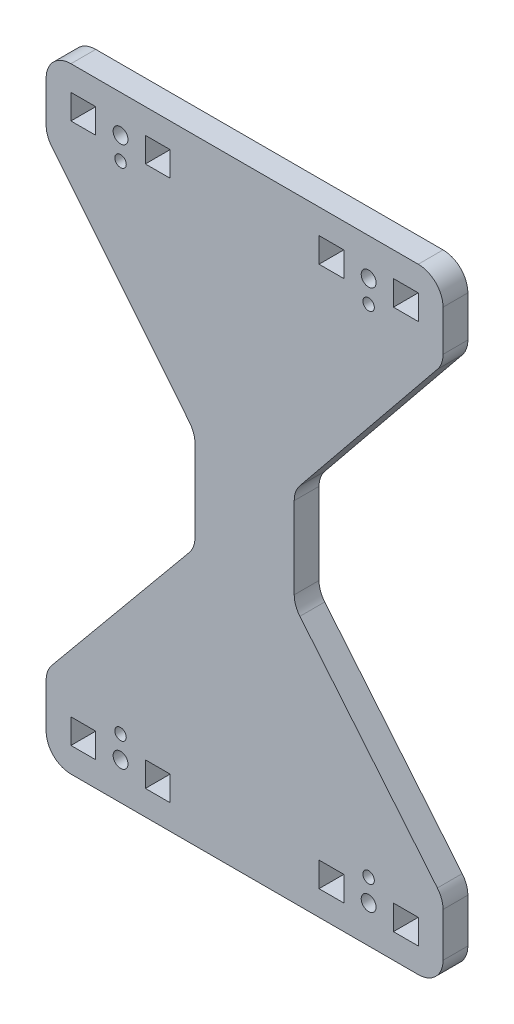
ISO-10303-21;
HEADER;
FILE_DESCRIPTION(('STEP AP214'),'2;1');
FILE_NAME('part.step','',(''),(''),'','','');
FILE_SCHEMA(('AUTOMOTIVE_DESIGN { 1 0 10303 214 1 1 1 1 }'));
ENDSEC;
DATA;
#1=APPLICATION_CONTEXT('core data for automotive mechanical design processes');
#2=APPLICATION_PROTOCOL_DEFINITION('international standard','automotive_design',2000,#1);
#3=PRODUCT_CONTEXT('',#1,'mechanical');
#4=PRODUCT('Part','Part','',(#3));
#5=PRODUCT_RELATED_PRODUCT_CATEGORY('part','',(#4));
#6=PRODUCT_DEFINITION_FORMATION('','',#4);
#7=PRODUCT_DEFINITION_CONTEXT('part definition',#1,'design');
#8=PRODUCT_DEFINITION('design','',#6,#7);
#9=PRODUCT_DEFINITION_SHAPE('','',#8);
#10=(LENGTH_UNIT() NAMED_UNIT(*) SI_UNIT(.MILLI.,.METRE.));
#11=(NAMED_UNIT(*) PLANE_ANGLE_UNIT() SI_UNIT($,.RADIAN.));
#12=(NAMED_UNIT(*) SI_UNIT($,.STERADIAN.) SOLID_ANGLE_UNIT());
#13=UNCERTAINTY_MEASURE_WITH_UNIT(LENGTH_MEASURE(1.E-05),#10,'distance_accuracy_value','');
#14=(GEOMETRIC_REPRESENTATION_CONTEXT(3) GLOBAL_UNCERTAINTY_ASSIGNED_CONTEXT((#13)) GLOBAL_UNIT_ASSIGNED_CONTEXT((#10,
#11,#12)) REPRESENTATION_CONTEXT('',''));
#15=CARTESIAN_POINT('',(0.,0.,0.));
#16=DIRECTION('',(0.,0.,1.));
#17=DIRECTION('',(1.,0.,0.));
#18=AXIS2_PLACEMENT_3D('',#15,#16,#17);
#19=CARTESIAN_POINT('',(0.,0.,5.));
#20=DIRECTION('',(0.,0.,1.));
#21=DIRECTION('',(1.,0.,0.));
#22=AXIS2_PLACEMENT_3D('',#19,#20,#21);
#23=PLANE('',#22);
#24=DIRECTION('',(-1.,0.,0.));
#25=VECTOR('',#24,1.);
#26=CARTESIAN_POINT('',(10.,119.,4.9999999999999));
#27=LINE('',#26,#25);
#28=CARTESIAN_POINT('',(10.,119.,4.9999999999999));
#29=VERTEX_POINT('',#28);
#30=CARTESIAN_POINT('',(5.00000000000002,119.,4.99999999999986));
#31=VERTEX_POINT('',#30);
#32=EDGE_CURVE('E401',#29,#31,#27,.T.);
#33=ORIENTED_EDGE('',*,*,#32,.F.);
#34=DIRECTION('',(0.,1.,0.));
#35=VECTOR('',#34,1.);
#36=CARTESIAN_POINT('',(10.,114.,4.99999999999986));
#37=LINE('',#36,#35);
#38=CARTESIAN_POINT('',(10.,114.,4.99999999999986));
#39=VERTEX_POINT('',#38);
#40=EDGE_CURVE('E391',#39,#29,#37,.T.);
#41=ORIENTED_EDGE('',*,*,#40,.F.);
#42=DIRECTION('',(1.,0.,0.));
#43=VECTOR('',#42,1.);
#44=CARTESIAN_POINT('',(10.,114.,4.99999999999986));
#45=LINE('',#44,#43);
#46=CARTESIAN_POINT('',(5.00000000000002,114.,5.));
#47=VERTEX_POINT('',#46);
#48=EDGE_CURVE('E417',#47,#39,#45,.T.);
#49=ORIENTED_EDGE('',*,*,#48,.F.);
#50=DIRECTION('',(0.,-1.,0.));
#51=VECTOR('',#50,1.);
#52=CARTESIAN_POINT('',(5.00000000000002,114.,4.99999999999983));
#53=LINE('',#52,#51);
#54=EDGE_CURVE('E415',#31,#47,#53,.T.);
#55=ORIENTED_EDGE('',*,*,#54,.F.);
#56=EDGE_LOOP('',(#33,#41,#49,#55));
#57=FACE_BOUND('',#56,.T.);
#58=DIRECTION('',(1.,0.,0.));
#59=VECTOR('',#58,1.);
#60=CARTESIAN_POINT('',(20.,114.,4.99999999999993));
#61=LINE('',#60,#59);
#62=CARTESIAN_POINT('',(20.,114.,4.99999999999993));
#63=VERTEX_POINT('',#62);
#64=CARTESIAN_POINT('',(25.,114.,4.99999999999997));
#65=VERTEX_POINT('',#64);
#66=EDGE_CURVE('E437',#63,#65,#61,.T.);
#67=ORIENTED_EDGE('',*,*,#66,.F.);
#68=DIRECTION('',(0.,-1.,0.));
#69=VECTOR('',#68,1.);
#70=CARTESIAN_POINT('',(20.,114.,4.99999999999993));
#71=LINE('',#70,#69);
#72=CARTESIAN_POINT('',(20.,119.,4.99999999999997));
#73=VERTEX_POINT('',#72);
#74=EDGE_CURVE('E435',#73,#63,#71,.T.);
#75=ORIENTED_EDGE('',*,*,#74,.F.);
#76=DIRECTION('',(-1.,0.,0.));
#77=VECTOR('',#76,1.);
#78=CARTESIAN_POINT('',(20.,119.,4.99999999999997));
#79=LINE('',#78,#77);
#80=CARTESIAN_POINT('',(25.,119.,5.));
#81=VERTEX_POINT('',#80);
#82=EDGE_CURVE('E443',#81,#73,#79,.T.);
#83=ORIENTED_EDGE('',*,*,#82,.F.);
#84=DIRECTION('',(0.,1.,0.));
#85=VECTOR('',#84,1.);
#86=CARTESIAN_POINT('',(25.,114.,4.99999999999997));
#87=LINE('',#86,#85);
#88=EDGE_CURVE('E440',#65,#81,#87,.T.);
#89=ORIENTED_EDGE('',*,*,#88,.F.);
#90=EDGE_LOOP('',(#67,#75,#83,#89));
#91=FACE_BOUND('',#90,.T.);
#92=CARTESIAN_POINT('',(65.,116.5,5.00000000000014));
#93=DIRECTION('',(0.,0.,1.));
#94=DIRECTION('',(0.,1.,0.));
#95=AXIS2_PLACEMENT_3D('',#92,#93,#94);
#96=CIRCLE('',#95,1.5);
#97=CARTESIAN_POINT('',(65.,118.,5.00000000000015));
#98=VERTEX_POINT('',#97);
#99=EDGE_CURVE('E466',#98,#98,#96,.T.);
#100=ORIENTED_EDGE('',*,*,#99,.F.);
#101=EDGE_LOOP('',(#100));
#102=FACE_BOUND('',#101,.T.);
#103=DIRECTION('',(-1.,0.,0.));
#104=VECTOR('',#103,1.);
#105=CARTESIAN_POINT('',(10.,9.99999999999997,5.00000000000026));
#106=LINE('',#105,#104);
#107=CARTESIAN_POINT('',(10.,9.99999999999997,5.00000000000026));
#108=VERTEX_POINT('',#107);
#109=CARTESIAN_POINT('',(5.00000000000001,9.99999999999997,5.0000000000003));
#110=VERTEX_POINT('',#109);
#111=EDGE_CURVE('E542',#108,#110,#106,.T.);
#112=ORIENTED_EDGE('',*,*,#111,.F.);
#113=DIRECTION('',(0.,1.,0.));
#114=VECTOR('',#113,1.);
#115=CARTESIAN_POINT('',(10.,9.99999999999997,5.00000000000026));
#116=LINE('',#115,#114);
#117=CARTESIAN_POINT('',(10.,4.99999999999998,5.00000000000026));
#118=VERTEX_POINT('',#117);
#119=EDGE_CURVE('E540',#118,#108,#116,.T.);
#120=ORIENTED_EDGE('',*,*,#119,.F.);
#121=DIRECTION('',(1.,0.,0.));
#122=VECTOR('',#121,1.);
#123=CARTESIAN_POINT('',(10.,4.99999999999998,5.00000000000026));
#124=LINE('',#123,#122);
#125=CARTESIAN_POINT('',(5.00000000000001,4.99999999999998,5.));
#126=VERTEX_POINT('',#125);
#127=EDGE_CURVE('E548',#126,#118,#124,.T.);
#128=ORIENTED_EDGE('',*,*,#127,.F.);
#129=DIRECTION('',(0.,-1.,0.));
#130=VECTOR('',#129,1.);
#131=CARTESIAN_POINT('',(5.00000000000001,9.99999999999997,5.0000000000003));
#132=LINE('',#131,#130);
#133=EDGE_CURVE('E545',#110,#126,#132,.T.);
#134=ORIENTED_EDGE('',*,*,#133,.F.);
#135=EDGE_LOOP('',(#112,#120,#128,#134));
#136=FACE_BOUND('',#135,.T.);
#137=DIRECTION('',(1.,0.,0.));
#138=VECTOR('',#137,1.);
#139=CARTESIAN_POINT('',(20.,4.99999999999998,5.00000000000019));
#140=LINE('',#139,#138);
#141=CARTESIAN_POINT('',(20.,4.99999999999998,5.00000000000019));
#142=VERTEX_POINT('',#141);
#143=CARTESIAN_POINT('',(25.,4.99999999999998,5.00000000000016));
#144=VERTEX_POINT('',#143);
#145=EDGE_CURVE('E573',#142,#144,#140,.T.);
#146=ORIENTED_EDGE('',*,*,#145,.F.);
#147=DIRECTION('',(0.,-1.,0.));
#148=VECTOR('',#147,1.);
#149=CARTESIAN_POINT('',(20.,9.99999999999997,5.00000000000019));
#150=LINE('',#149,#148);
#151=CARTESIAN_POINT('',(20.,9.99999999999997,5.00000000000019));
#152=VERTEX_POINT('',#151);
#153=EDGE_CURVE('E571',#152,#142,#150,.T.);
#154=ORIENTED_EDGE('',*,*,#153,.F.);
#155=DIRECTION('',(-1.,0.,0.));
#156=VECTOR('',#155,1.);
#157=CARTESIAN_POINT('',(20.,9.99999999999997,5.00000000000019));
#158=LINE('',#157,#156);
#159=CARTESIAN_POINT('',(25.,9.99999999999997,5.));
#160=VERTEX_POINT('',#159);
#161=EDGE_CURVE('E579',#160,#152,#158,.T.);
#162=ORIENTED_EDGE('',*,*,#161,.F.);
#163=DIRECTION('',(0.,1.,0.));
#164=VECTOR('',#163,1.);
#165=CARTESIAN_POINT('',(25.,9.99999999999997,5.00000000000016));
#166=LINE('',#165,#164);
#167=EDGE_CURVE('E576',#144,#160,#166,.T.);
#168=ORIENTED_EDGE('',*,*,#167,.F.);
#169=EDGE_LOOP('',(#146,#154,#162,#168));
#170=FACE_BOUND('',#169,.T.);
#171=CARTESIAN_POINT('',(65.,7.49999999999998,5.));
#172=DIRECTION('',(0.,0.,1.));
#173=DIRECTION('',(1.,0.,0.));
#174=AXIS2_PLACEMENT_3D('',#171,#172,#173);
#175=CIRCLE('',#174,1.5);
#176=CARTESIAN_POINT('',(66.5,7.49999999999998,5.));
#177=VERTEX_POINT('',#176);
#178=EDGE_CURVE('E602',#177,#177,#175,.T.);
#179=ORIENTED_EDGE('',*,*,#178,.F.);
#180=EDGE_LOOP('',(#179));
#181=FACE_BOUND('',#180,.T.);
#182=CARTESIAN_POINT('',(15.,12.,5.));
#183=DIRECTION('',(0.,0.,1.));
#184=DIRECTION('',(-1.,0.,0.));
#185=AXIS2_PLACEMENT_3D('',#182,#183,#184);
#186=CIRCLE('',#185,1.15);
#187=CARTESIAN_POINT('',(13.85,12.,5.));
#188=VERTEX_POINT('',#187);
#189=EDGE_CURVE('E676',#188,#188,#186,.T.);
#190=ORIENTED_EDGE('',*,*,#189,.F.);
#191=EDGE_LOOP('',(#190));
#192=FACE_BOUND('',#191,.T.);
#193=CARTESIAN_POINT('',(15.,112.,5.));
#194=DIRECTION('',(0.,0.,1.));
#195=DIRECTION('',(1.,0.,0.));
#196=AXIS2_PLACEMENT_3D('',#193,#194,#195);
#197=CIRCLE('',#196,1.15);
#198=CARTESIAN_POINT('',(16.15,112.,5.));
#199=VERTEX_POINT('',#198);
#200=EDGE_CURVE('E688',#199,#199,#197,.T.);
#201=ORIENTED_EDGE('',*,*,#200,.F.);
#202=EDGE_LOOP('',(#201));
#203=FACE_BOUND('',#202,.T.);
#204=DIRECTION('',(0.,1.,0.));
#205=VECTOR('',#204,1.);
#206=CARTESIAN_POINT('',(80.,109.,5.));
#207=LINE('',#206,#205);
#208=CARTESIAN_POINT('',(80.,110.77233690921,5.));
#209=VERTEX_POINT('',#208);
#210=CARTESIAN_POINT('',(80.,119.,5.));
#211=VERTEX_POINT('',#210);
#212=EDGE_CURVE('E713',#209,#211,#207,.T.);
#213=ORIENTED_EDGE('',*,*,#212,.T.);
#214=CARTESIAN_POINT('',(75.,119.,5.));
#215=DIRECTION('',(0.,0.,1.));
#216=DIRECTION('',(1.,0.,0.));
#217=AXIS2_PLACEMENT_3D('',#214,#215,#216);
#218=CIRCLE('',#217,5.);
#219=CARTESIAN_POINT('',(75.,124.,5.));
#220=VERTEX_POINT('',#219);
#221=EDGE_CURVE('E802',#211,#220,#218,.T.);
#222=ORIENTED_EDGE('',*,*,#221,.T.);
#223=DIRECTION('',(-1.,0.,0.));
#224=VECTOR('',#223,1.);
#225=CARTESIAN_POINT('',(0.,124.,5.));
#226=LINE('',#225,#224);
#227=CARTESIAN_POINT('',(5.,124.,5.));
#228=VERTEX_POINT('',#227);
#229=EDGE_CURVE('E716',#220,#228,#226,.T.);
#230=ORIENTED_EDGE('',*,*,#229,.T.);
#231=CARTESIAN_POINT('',(5.,119.,5.));
#232=DIRECTION('',(0.,0.,1.));
#233=DIRECTION('',(1.,0.,0.));
#234=AXIS2_PLACEMENT_3D('',#231,#232,#233);
#235=CIRCLE('',#234,5.);
#236=CARTESIAN_POINT('',(0.,119.,5.));
#237=VERTEX_POINT('',#236);
#238=EDGE_CURVE('E788',#228,#237,#235,.T.);
#239=ORIENTED_EDGE('',*,*,#238,.T.);
#240=DIRECTION('',(0.,-1.,0.));
#241=VECTOR('',#240,1.);
#242=CARTESIAN_POINT('',(0.,124.,5.));
#243=LINE('',#242,#241);
#244=CARTESIAN_POINT('',(0.,110.77233690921,5.));
#245=VERTEX_POINT('',#244);
#246=EDGE_CURVE('E719',#237,#245,#243,.T.);
#247=ORIENTED_EDGE('',*,*,#246,.T.);
#248=CARTESIAN_POINT('',(5.,110.77233690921,5.));
#249=DIRECTION('',(0.,0.,1.));
#250=DIRECTION('',(1.,0.,0.));
#251=AXIS2_PLACEMENT_3D('',#248,#249,#250);
#252=CIRCLE('',#251,5.);
#253=CARTESIAN_POINT('',(1.11622125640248,107.623327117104,5.));
#254=VERTEX_POINT('',#253);
#255=EDGE_CURVE('E790',#245,#254,#252,.T.);
#256=ORIENTED_EDGE('',*,*,#255,.T.);
#257=DIRECTION('',(0.62980195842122,-0.776755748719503,0.));
#258=VECTOR('',#257,1.);
#259=CARTESIAN_POINT('',(0.,109.,5.));
#260=LINE('',#259,#258);
#261=CARTESIAN_POINT('',(28.8837787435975,73.3766728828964,5.));
#262=VERTEX_POINT('',#261);
#263=EDGE_CURVE('E722',#254,#262,#260,.T.);
#264=ORIENTED_EDGE('',*,*,#263,.T.);
#265=CARTESIAN_POINT('',(25.,70.2276630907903,5.));
#266=DIRECTION('',(0.,0.,1.));
#267=DIRECTION('',(1.,0.,0.));
#268=AXIS2_PLACEMENT_3D('',#265,#266,#267);
#269=CIRCLE('',#268,5.);
#270=CARTESIAN_POINT('',(30.,70.2276630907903,5.));
#271=VERTEX_POINT('',#270);
#272=EDGE_CURVE('E11',#262,#271,#269,.F.);
#273=ORIENTED_EDGE('',*,*,#272,.T.);
#274=DIRECTION('',(0.,-1.,0.));
#275=VECTOR('',#274,1.);
#276=CARTESIAN_POINT('',(30.,72.,5.));
#277=LINE('',#276,#275);
#278=CARTESIAN_POINT('',(30.,53.7975586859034,5.));
#279=VERTEX_POINT('',#278);
#280=EDGE_CURVE('E725',#271,#279,#277,.T.);
#281=ORIENTED_EDGE('',*,*,#280,.T.);
#282=CARTESIAN_POINT('',(25.,53.7975586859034,5.));
#283=DIRECTION('',(0.,0.,1.));
#284=DIRECTION('',(1.,0.,0.));
#285=AXIS2_PLACEMENT_3D('',#282,#283,#284);
#286=CIRCLE('',#285,5.);
#287=CARTESIAN_POINT('',(28.8554453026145,50.6139221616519,5.));
#288=VERTEX_POINT('',#287);
#289=EDGE_CURVE('E58',#279,#288,#286,.F.);
#290=ORIENTED_EDGE('',*,*,#289,.T.);
#291=DIRECTION('',(-0.6367273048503,-0.77108906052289,0.));
#292=VECTOR('',#291,1.);
#293=CARTESIAN_POINT('',(30.,52.,5.));
#294=LINE('',#293,#292);
#295=CARTESIAN_POINT('',(1.14455469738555,17.0554985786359,5.));
#296=VERTEX_POINT('',#295);
#297=EDGE_CURVE('E727',#288,#296,#294,.T.);
#298=ORIENTED_EDGE('',*,*,#297,.T.);
#299=CARTESIAN_POINT('',(5.,13.8718620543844,5.));
#300=DIRECTION('',(0.,0.,1.));
#301=DIRECTION('',(1.,0.,0.));
#302=AXIS2_PLACEMENT_3D('',#299,#300,#301);
#303=CIRCLE('',#302,5.);
#304=CARTESIAN_POINT('',(0.,13.8718620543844,5.));
#305=VERTEX_POINT('',#304);
#306=EDGE_CURVE('E792',#296,#305,#303,.T.);
#307=ORIENTED_EDGE('',*,*,#306,.T.);
#308=DIRECTION('',(0.,-1.,0.));
#309=VECTOR('',#308,1.);
#310=CARTESIAN_POINT('',(0.,15.6694207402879,5.));
#311=LINE('',#310,#309);
#312=CARTESIAN_POINT('',(0.,5.,5.));
#313=VERTEX_POINT('',#312);
#314=EDGE_CURVE('E694',#305,#313,#311,.T.);
#315=ORIENTED_EDGE('',*,*,#314,.T.);
#316=CARTESIAN_POINT('',(5.,5.,5.));
#317=DIRECTION('',(0.,0.,1.));
#318=DIRECTION('',(1.,0.,0.));
#319=AXIS2_PLACEMENT_3D('',#316,#317,#318);
#320=CIRCLE('',#319,5.);
#321=CARTESIAN_POINT('',(5.,0.,5.));
#322=VERTEX_POINT('',#321);
#323=EDGE_CURVE('E794',#313,#322,#320,.T.);
#324=ORIENTED_EDGE('',*,*,#323,.T.);
#325=DIRECTION('',(1.,0.,0.));
#326=VECTOR('',#325,1.);
#327=CARTESIAN_POINT('',(0.,0.,5.));
#328=LINE('',#327,#326);
#329=CARTESIAN_POINT('',(75.,0.,5.));
#330=VERTEX_POINT('',#329);
#331=EDGE_CURVE('E697',#322,#330,#328,.T.);
#332=ORIENTED_EDGE('',*,*,#331,.T.);
#333=CARTESIAN_POINT('',(75.,5.,5.));
#334=DIRECTION('',(0.,0.,1.));
#335=DIRECTION('',(1.,0.,0.));
#336=AXIS2_PLACEMENT_3D('',#333,#334,#335);
#337=CIRCLE('',#336,5.);
#338=CARTESIAN_POINT('',(80.,5.,5.));
#339=VERTEX_POINT('',#338);
#340=EDGE_CURVE('E796',#330,#339,#337,.T.);
#341=ORIENTED_EDGE('',*,*,#340,.T.);
#342=DIRECTION('',(0.,1.,0.));
#343=VECTOR('',#342,1.);
#344=CARTESIAN_POINT('',(80.,0.,5.));
#345=LINE('',#344,#343);
#346=CARTESIAN_POINT('',(80.,13.8718620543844,5.));
#347=VERTEX_POINT('',#346);
#348=EDGE_CURVE('E701',#339,#347,#345,.T.);
#349=ORIENTED_EDGE('',*,*,#348,.T.);
#350=CARTESIAN_POINT('',(75.,13.8718620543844,5.));
#351=DIRECTION('',(0.,0.,1.));
#352=DIRECTION('',(1.,0.,0.));
#353=AXIS2_PLACEMENT_3D('',#350,#351,#352);
#354=CIRCLE('',#353,5.);
#355=CARTESIAN_POINT('',(78.8554453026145,17.0554985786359,5.));
#356=VERTEX_POINT('',#355);
#357=EDGE_CURVE('E798',#347,#356,#354,.T.);
#358=ORIENTED_EDGE('',*,*,#357,.T.);
#359=DIRECTION('',(-0.6367273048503,0.77108906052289,0.));
#360=VECTOR('',#359,1.);
#361=CARTESIAN_POINT('',(80.,15.6694207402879,5.));
#362=LINE('',#361,#360);
#363=CARTESIAN_POINT('',(51.1445546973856,50.6139221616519,5.));
#364=VERTEX_POINT('',#363);
#365=EDGE_CURVE('E704',#356,#364,#362,.T.);
#366=ORIENTED_EDGE('',*,*,#365,.T.);
#367=CARTESIAN_POINT('',(55.,53.7975586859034,5.));
#368=DIRECTION('',(0.,0.,1.));
#369=DIRECTION('',(1.,0.,0.));
#370=AXIS2_PLACEMENT_3D('',#367,#368,#369);
#371=CIRCLE('',#370,5.);
#372=CARTESIAN_POINT('',(50.,53.7975586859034,5.));
#373=VERTEX_POINT('',#372);
#374=EDGE_CURVE('E859',#364,#373,#371,.F.);
#375=ORIENTED_EDGE('',*,*,#374,.T.);
#376=DIRECTION('',(0.,1.,0.));
#377=VECTOR('',#376,1.);
#378=CARTESIAN_POINT('',(50.,52.,5.));
#379=LINE('',#378,#377);
#380=CARTESIAN_POINT('',(50.,70.2276630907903,5.));
#381=VERTEX_POINT('',#380);
#382=EDGE_CURVE('E707',#373,#381,#379,.T.);
#383=ORIENTED_EDGE('',*,*,#382,.T.);
#384=CARTESIAN_POINT('',(55.,70.2276630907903,5.));
#385=DIRECTION('',(0.,0.,1.));
#386=DIRECTION('',(1.,0.,0.));
#387=AXIS2_PLACEMENT_3D('',#384,#385,#386);
#388=CIRCLE('',#387,5.);
#389=CARTESIAN_POINT('',(51.1162212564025,73.3766728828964,5.));
#390=VERTEX_POINT('',#389);
#391=EDGE_CURVE('E855',#381,#390,#388,.F.);
#392=ORIENTED_EDGE('',*,*,#391,.T.);
#393=DIRECTION('',(0.62980195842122,0.776755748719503,0.));
#394=VECTOR('',#393,1.);
#395=CARTESIAN_POINT('',(50.,72.,5.));
#396=LINE('',#395,#394);
#397=CARTESIAN_POINT('',(78.8837787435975,107.623327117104,5.));
#398=VERTEX_POINT('',#397);
#399=EDGE_CURVE('E710',#390,#398,#396,.T.);
#400=ORIENTED_EDGE('',*,*,#399,.T.);
#401=CARTESIAN_POINT('',(75.,110.77233690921,5.));
#402=DIRECTION('',(0.,0.,1.));
#403=DIRECTION('',(1.,0.,0.));
#404=AXIS2_PLACEMENT_3D('',#401,#402,#403);
#405=CIRCLE('',#404,5.);
#406=EDGE_CURVE('E800',#398,#209,#405,.T.);
#407=ORIENTED_EDGE('',*,*,#406,.T.);
#408=EDGE_LOOP('',(#213,#222,#230,#239,#247,#256,#264,#273,#281,#290,#298,#307,#315,#324,#332,
#341,#349,#358,#366,#375,#383,#392,#400,#407));
#409=FACE_BOUND('',#408,.T.);
#410=CARTESIAN_POINT('',(65.,112.,5.));
#411=DIRECTION('',(0.,0.,1.));
#412=DIRECTION('',(-1.,0.,0.));
#413=AXIS2_PLACEMENT_3D('',#410,#411,#412);
#414=CIRCLE('',#413,1.15);
#415=CARTESIAN_POINT('',(63.85,112.,5.));
#416=VERTEX_POINT('',#415);
#417=EDGE_CURVE('E682',#416,#416,#414,.T.);
#418=ORIENTED_EDGE('',*,*,#417,.F.);
#419=EDGE_LOOP('',(#418));
#420=FACE_BOUND('',#419,.T.);
#421=CARTESIAN_POINT('',(65.,12.,5.));
#422=DIRECTION('',(0.,0.,1.));
#423=DIRECTION('',(1.,0.,0.));
#424=AXIS2_PLACEMENT_3D('',#421,#422,#423);
#425=CIRCLE('',#424,1.15);
#426=CARTESIAN_POINT('',(66.15,12.,5.));
#427=VERTEX_POINT('',#426);
#428=EDGE_CURVE('E670',#427,#427,#425,.T.);
#429=ORIENTED_EDGE('',*,*,#428,.F.);
#430=EDGE_LOOP('',(#429));
#431=FACE_BOUND('',#430,.T.);
#432=DIRECTION('',(-1.,0.,0.));
#433=VECTOR('',#432,1.);
#434=CARTESIAN_POINT('',(60.,9.99999999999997,5.));
#435=LINE('',#434,#433);
#436=CARTESIAN_POINT('',(60.,9.99999999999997,5.));
#437=VERTEX_POINT('',#436);
#438=CARTESIAN_POINT('',(55.,9.99999999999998,5.));
#439=VERTEX_POINT('',#438);
#440=EDGE_CURVE('E641',#437,#439,#435,.T.);
#441=ORIENTED_EDGE('',*,*,#440,.F.);
#442=DIRECTION('',(0.,1.,0.));
#443=VECTOR('',#442,1.);
#444=CARTESIAN_POINT('',(60.,9.99999999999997,5.));
#445=LINE('',#444,#443);
#446=CARTESIAN_POINT('',(60.,4.99999999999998,5.));
#447=VERTEX_POINT('',#446);
#448=EDGE_CURVE('E639',#447,#437,#445,.T.);
#449=ORIENTED_EDGE('',*,*,#448,.F.);
#450=DIRECTION('',(1.,0.,0.));
#451=VECTOR('',#450,1.);
#452=CARTESIAN_POINT('',(60.,4.99999999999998,5.));
#453=LINE('',#452,#451);
#454=CARTESIAN_POINT('',(55.,4.99999999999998,5.));
#455=VERTEX_POINT('',#454);
#456=EDGE_CURVE('E647',#455,#447,#453,.T.);
#457=ORIENTED_EDGE('',*,*,#456,.F.);
#458=DIRECTION('',(0.,-1.,0.));
#459=VECTOR('',#458,1.);
#460=CARTESIAN_POINT('',(55.,9.99999999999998,5.));
#461=LINE('',#460,#459);
#462=EDGE_CURVE('E644',#439,#455,#461,.T.);
#463=ORIENTED_EDGE('',*,*,#462,.F.);
#464=EDGE_LOOP('',(#441,#449,#457,#463));
#465=FACE_BOUND('',#464,.T.);
#466=DIRECTION('',(1.,0.,0.));
#467=VECTOR('',#466,1.);
#468=CARTESIAN_POINT('',(70.,4.99999999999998,5.));
#469=LINE('',#468,#467);
#470=CARTESIAN_POINT('',(70.,4.99999999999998,5.));
#471=VERTEX_POINT('',#470);
#472=CARTESIAN_POINT('',(75.,4.99999999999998,5.));
#473=VERTEX_POINT('',#472);
#474=EDGE_CURVE('E610',#471,#473,#469,.T.);
#475=ORIENTED_EDGE('',*,*,#474,.F.);
#476=DIRECTION('',(0.,-1.,0.));
#477=VECTOR('',#476,1.);
#478=CARTESIAN_POINT('',(70.,9.99999999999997,5.));
#479=LINE('',#478,#477);
#480=CARTESIAN_POINT('',(70.,9.99999999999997,5.));
#481=VERTEX_POINT('',#480);
#482=EDGE_CURVE('E608',#481,#471,#479,.T.);
#483=ORIENTED_EDGE('',*,*,#482,.F.);
#484=DIRECTION('',(-1.,0.,0.));
#485=VECTOR('',#484,1.);
#486=CARTESIAN_POINT('',(70.,9.99999999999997,5.));
#487=LINE('',#486,#485);
#488=CARTESIAN_POINT('',(75.,9.99999999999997,5.));
#489=VERTEX_POINT('',#488);
#490=EDGE_CURVE('E616',#489,#481,#487,.T.);
#491=ORIENTED_EDGE('',*,*,#490,.F.);
#492=DIRECTION('',(0.,1.,0.));
#493=VECTOR('',#492,1.);
#494=CARTESIAN_POINT('',(75.,9.99999999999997,5.));
#495=LINE('',#494,#493);
#496=EDGE_CURVE('E613',#473,#489,#495,.T.);
#497=ORIENTED_EDGE('',*,*,#496,.F.);
#498=EDGE_LOOP('',(#475,#483,#491,#497));
#499=FACE_BOUND('',#498,.T.);
#500=CARTESIAN_POINT('',(15.,7.49999999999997,5.00000000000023));
#501=DIRECTION('',(0.,0.,1.));
#502=DIRECTION('',(-1.,0.,0.));
#503=AXIS2_PLACEMENT_3D('',#500,#501,#502);
#504=CIRCLE('',#503,1.5);
#505=CARTESIAN_POINT('',(13.5,7.49999999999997,5.00000000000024));
#506=VERTEX_POINT('',#505);
#507=EDGE_CURVE('E534',#506,#506,#504,.T.);
#508=ORIENTED_EDGE('',*,*,#507,.F.);
#509=EDGE_LOOP('',(#508));
#510=FACE_BOUND('',#509,.T.);
#511=DIRECTION('',(-1.,0.,0.));
#512=VECTOR('',#511,1.);
#513=CARTESIAN_POINT('',(60.,119.,5.00000000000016));
#514=LINE('',#513,#512);
#515=CARTESIAN_POINT('',(60.,119.,5.00000000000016));
#516=VERTEX_POINT('',#515);
#517=CARTESIAN_POINT('',(55.,119.,5.00000000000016));
#518=VERTEX_POINT('',#517);
#519=EDGE_CURVE('E505',#516,#518,#514,.T.);
#520=ORIENTED_EDGE('',*,*,#519,.F.);
#521=DIRECTION('',(0.,1.,0.));
#522=VECTOR('',#521,1.);
#523=CARTESIAN_POINT('',(60.,114.,5.00000000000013));
#524=LINE('',#523,#522);
#525=CARTESIAN_POINT('',(60.,114.,5.00000000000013));
#526=VERTEX_POINT('',#525);
#527=EDGE_CURVE('E503',#526,#516,#524,.T.);
#528=ORIENTED_EDGE('',*,*,#527,.F.);
#529=DIRECTION('',(1.,0.,0.));
#530=VECTOR('',#529,1.);
#531=CARTESIAN_POINT('',(60.,114.,5.00000000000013));
#532=LINE('',#531,#530);
#533=CARTESIAN_POINT('',(55.,114.,5.));
#534=VERTEX_POINT('',#533);
#535=EDGE_CURVE('E511',#534,#526,#532,.T.);
#536=ORIENTED_EDGE('',*,*,#535,.F.);
#537=DIRECTION('',(0.,-1.,0.));
#538=VECTOR('',#537,1.);
#539=CARTESIAN_POINT('',(55.,114.,5.00000000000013));
#540=LINE('',#539,#538);
#541=EDGE_CURVE('E508',#518,#534,#540,.T.);
#542=ORIENTED_EDGE('',*,*,#541,.F.);
#543=EDGE_LOOP('',(#520,#528,#536,#542));
#544=FACE_BOUND('',#543,.T.);
#545=DIRECTION('',(1.,0.,0.));
#546=VECTOR('',#545,1.);
#547=CARTESIAN_POINT('',(70.,114.,5.00000000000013));
#548=LINE('',#547,#546);
#549=CARTESIAN_POINT('',(70.,114.,5.00000000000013));
#550=VERTEX_POINT('',#549);
#551=CARTESIAN_POINT('',(75.,114.,5.00000000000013));
#552=VERTEX_POINT('',#551);
#553=EDGE_CURVE('E474',#550,#552,#548,.T.);
#554=ORIENTED_EDGE('',*,*,#553,.F.);
#555=DIRECTION('',(0.,-1.,0.));
#556=VECTOR('',#555,1.);
#557=CARTESIAN_POINT('',(70.,114.,5.00000000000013));
#558=LINE('',#557,#556);
#559=CARTESIAN_POINT('',(70.,119.,5.00000000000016));
#560=VERTEX_POINT('',#559);
#561=EDGE_CURVE('E472',#560,#550,#558,.T.);
#562=ORIENTED_EDGE('',*,*,#561,.F.);
#563=DIRECTION('',(-1.,0.,0.));
#564=VECTOR('',#563,1.);
#565=CARTESIAN_POINT('',(70.,119.,5.00000000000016));
#566=LINE('',#565,#564);
#567=CARTESIAN_POINT('',(75.,119.,5.));
#568=VERTEX_POINT('',#567);
#569=EDGE_CURVE('E480',#568,#560,#566,.T.);
#570=ORIENTED_EDGE('',*,*,#569,.F.);
#571=DIRECTION('',(0.,1.,0.));
#572=VECTOR('',#571,1.);
#573=CARTESIAN_POINT('',(75.,114.,5.00000000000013));
#574=LINE('',#573,#572);
#575=EDGE_CURVE('E477',#552,#568,#574,.T.);
#576=ORIENTED_EDGE('',*,*,#575,.F.);
#577=EDGE_LOOP('',(#554,#562,#570,#576));
#578=FACE_BOUND('',#577,.T.);
#579=CARTESIAN_POINT('',(15.,116.5,4.99999999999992));
#580=DIRECTION('',(0.,0.,1.));
#581=DIRECTION('',(1.,0.,0.));
#582=AXIS2_PLACEMENT_3D('',#579,#580,#581);
#583=CIRCLE('',#582,1.5);
#584=CARTESIAN_POINT('',(16.5,116.5,4.99999999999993));
#585=VERTEX_POINT('',#584);
#586=EDGE_CURVE('E424',#585,#585,#583,.T.);
#587=ORIENTED_EDGE('',*,*,#586,.F.);
#588=EDGE_LOOP('',(#587));
#589=FACE_BOUND('',#588,.T.);
#590=ADVANCED_FACE('F36',(#57,#91,#102,#136,#170,#181,#192,#203,#409,#420,#431,#465,#499,#510,
#544,#578,#589),#23,.T.);
#591=CARTESIAN_POINT('',(0.,0.,0.));
#592=DIRECTION('',(0.,0.,1.));
#593=DIRECTION('',(1.,0.,0.));
#594=AXIS2_PLACEMENT_3D('',#591,#592,#593);
#595=PLANE('',#594);
#596=DIRECTION('',(0.,-1.,0.));
#597=VECTOR('',#596,1.);
#598=CARTESIAN_POINT('',(20.,114.,0.));
#599=LINE('',#598,#597);
#600=CARTESIAN_POINT('',(20.,119.,0.));
#601=VERTEX_POINT('',#600);
#602=CARTESIAN_POINT('',(20.,114.,0.));
#603=VERTEX_POINT('',#602);
#604=EDGE_CURVE('E409',#601,#603,#599,.T.);
#605=ORIENTED_EDGE('',*,*,#604,.T.);
#606=DIRECTION('',(1.,0.,0.));
#607=VECTOR('',#606,1.);
#608=CARTESIAN_POINT('',(20.,114.,0.));
#609=LINE('',#608,#607);
#610=CARTESIAN_POINT('',(25.,114.,0.));
#611=VERTEX_POINT('',#610);
#612=EDGE_CURVE('E448',#603,#611,#609,.T.);
#613=ORIENTED_EDGE('',*,*,#612,.T.);
#614=DIRECTION('',(0.,1.,0.));
#615=VECTOR('',#614,1.);
#616=CARTESIAN_POINT('',(25.,114.,0.));
#617=LINE('',#616,#615);
#618=CARTESIAN_POINT('',(25.,119.,0.));
#619=VERTEX_POINT('',#618);
#620=EDGE_CURVE('E451',#611,#619,#617,.T.);
#621=ORIENTED_EDGE('',*,*,#620,.T.);
#622=DIRECTION('',(-1.,0.,0.));
#623=VECTOR('',#622,1.);
#624=CARTESIAN_POINT('',(20.,119.,0.));
#625=LINE('',#624,#623);
#626=EDGE_CURVE('E438',#619,#601,#625,.T.);
#627=ORIENTED_EDGE('',*,*,#626,.T.);
#628=EDGE_LOOP('',(#605,#613,#621,#627));
#629=FACE_BOUND('',#628,.T.);
#630=DIRECTION('',(0.,1.,0.));
#631=VECTOR('',#630,1.);
#632=CARTESIAN_POINT('',(60.,114.,1.25402948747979E-13));
#633=LINE('',#632,#631);
#634=CARTESIAN_POINT('',(60.,114.,0.));
#635=VERTEX_POINT('',#634);
#636=CARTESIAN_POINT('',(60.,119.,1.6031776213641E-13));
#637=VERTEX_POINT('',#636);
#638=EDGE_CURVE('E502',#635,#637,#633,.T.);
#639=ORIENTED_EDGE('',*,*,#638,.T.);
#640=DIRECTION('',(-1.,0.,0.));
#641=VECTOR('',#640,1.);
#642=CARTESIAN_POINT('',(60.,119.,1.6031776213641E-13));
#643=LINE('',#642,#641);
#644=CARTESIAN_POINT('',(55.,119.,1.6031776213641E-13));
#645=VERTEX_POINT('',#644);
#646=EDGE_CURVE('E516',#637,#645,#643,.T.);
#647=ORIENTED_EDGE('',*,*,#646,.T.);
#648=DIRECTION('',(0.,-1.,0.));
#649=VECTOR('',#648,1.);
#650=CARTESIAN_POINT('',(55.,114.,1.25402948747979E-13));
#651=LINE('',#650,#649);
#652=CARTESIAN_POINT('',(55.,114.,1.25402948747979E-13));
#653=VERTEX_POINT('',#652);
#654=EDGE_CURVE('E519',#645,#653,#651,.T.);
#655=ORIENTED_EDGE('',*,*,#654,.T.);
#656=DIRECTION('',(1.,0.,0.));
#657=VECTOR('',#656,1.);
#658=CARTESIAN_POINT('',(60.,114.,1.25402948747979E-13));
#659=LINE('',#658,#657);
#660=EDGE_CURVE('E506',#653,#635,#659,.T.);
#661=ORIENTED_EDGE('',*,*,#660,.T.);
#662=EDGE_LOOP('',(#639,#647,#655,#661));
#663=FACE_BOUND('',#662,.T.);
#664=DIRECTION('',(0.,-1.,0.));
#665=VECTOR('',#664,1.);
#666=CARTESIAN_POINT('',(20.,9.99999999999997,1.92486066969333E-13));
#667=LINE('',#666,#665);
#668=CARTESIAN_POINT('',(20.,9.99999999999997,0.));
#669=VERTEX_POINT('',#668);
#670=CARTESIAN_POINT('',(20.,4.99999999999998,1.92486066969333E-13));
#671=VERTEX_POINT('',#670);
#672=EDGE_CURVE('E570',#669,#671,#667,.T.);
#673=ORIENTED_EDGE('',*,*,#672,.T.);
#674=DIRECTION('',(1.,0.,0.));
#675=VECTOR('',#674,1.);
#676=CARTESIAN_POINT('',(20.,4.99999999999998,1.92486066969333E-13));
#677=LINE('',#676,#675);
#678=CARTESIAN_POINT('',(25.,4.99999999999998,1.57571253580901E-13));
#679=VERTEX_POINT('',#678);
#680=EDGE_CURVE('E584',#671,#679,#677,.T.);
#681=ORIENTED_EDGE('',*,*,#680,.T.);
#682=DIRECTION('',(0.,1.,0.));
#683=VECTOR('',#682,1.);
#684=CARTESIAN_POINT('',(25.,9.99999999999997,1.57571253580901E-13));
#685=LINE('',#684,#683);
#686=CARTESIAN_POINT('',(25.,9.99999999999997,1.57571253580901E-13));
#687=VERTEX_POINT('',#686);
#688=EDGE_CURVE('E587',#679,#687,#685,.T.);
#689=ORIENTED_EDGE('',*,*,#688,.T.);
#690=DIRECTION('',(-1.,0.,0.));
#691=VECTOR('',#690,1.);
#692=CARTESIAN_POINT('',(20.,9.99999999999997,1.92486066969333E-13));
#693=LINE('',#692,#691);
#694=EDGE_CURVE('E574',#687,#669,#693,.T.);
#695=ORIENTED_EDGE('',*,*,#694,.T.);
#696=EDGE_LOOP('',(#673,#681,#689,#695));
#697=FACE_BOUND('',#696,.T.);
#698=DIRECTION('',(0.,1.,0.));
#699=VECTOR('',#698,1.);
#700=CARTESIAN_POINT('',(60.,9.99999999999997,0.));
#701=LINE('',#700,#699);
#702=CARTESIAN_POINT('',(60.,4.99999999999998,0.));
#703=VERTEX_POINT('',#702);
#704=CARTESIAN_POINT('',(60.,9.99999999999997,0.));
#705=VERTEX_POINT('',#704);
#706=EDGE_CURVE('E638',#703,#705,#701,.T.);
#707=ORIENTED_EDGE('',*,*,#706,.T.);
#708=DIRECTION('',(-1.,0.,0.));
#709=VECTOR('',#708,1.);
#710=CARTESIAN_POINT('',(60.,9.99999999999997,0.));
#711=LINE('',#710,#709);
#712=CARTESIAN_POINT('',(55.,9.99999999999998,0.));
#713=VERTEX_POINT('',#712);
#714=EDGE_CURVE('E652',#705,#713,#711,.T.);
#715=ORIENTED_EDGE('',*,*,#714,.T.);
#716=DIRECTION('',(0.,-1.,0.));
#717=VECTOR('',#716,1.);
#718=CARTESIAN_POINT('',(55.,9.99999999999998,0.));
#719=LINE('',#718,#717);
#720=CARTESIAN_POINT('',(55.,4.99999999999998,0.));
#721=VERTEX_POINT('',#720);
#722=EDGE_CURVE('E655',#713,#721,#719,.T.);
#723=ORIENTED_EDGE('',*,*,#722,.T.);
#724=DIRECTION('',(1.,0.,0.));
#725=VECTOR('',#724,1.);
#726=CARTESIAN_POINT('',(60.,4.99999999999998,0.));
#727=LINE('',#726,#725);
#728=EDGE_CURVE('E642',#721,#703,#727,.T.);
#729=ORIENTED_EDGE('',*,*,#728,.T.);
#730=EDGE_LOOP('',(#707,#715,#723,#729));
#731=FACE_BOUND('',#730,.T.);
#732=DIRECTION('',(-1.,0.,0.));
#733=VECTOR('',#732,1.);
#734=CARTESIAN_POINT('',(0.,124.,0.));
#735=LINE('',#734,#733);
#736=CARTESIAN_POINT('',(75.,124.,0.));
#737=VERTEX_POINT('',#736);
#738=CARTESIAN_POINT('',(5.,124.,0.));
#739=VERTEX_POINT('',#738);
#740=EDGE_CURVE('E750',#737,#739,#735,.T.);
#741=ORIENTED_EDGE('',*,*,#740,.F.);
#742=CARTESIAN_POINT('',(75.,119.,0.));
#743=DIRECTION('',(0.,0.,1.));
#744=DIRECTION('',(1.,0.,0.));
#745=AXIS2_PLACEMENT_3D('',#742,#743,#744);
#746=CIRCLE('',#745,5.);
#747=CARTESIAN_POINT('',(80.,119.,0.));
#748=VERTEX_POINT('',#747);
#749=EDGE_CURVE('E781',#737,#748,#746,.F.);
#750=ORIENTED_EDGE('',*,*,#749,.T.);
#751=DIRECTION('',(0.,1.,0.));
#752=VECTOR('',#751,1.);
#753=CARTESIAN_POINT('',(80.,109.,0.));
#754=LINE('',#753,#752);
#755=CARTESIAN_POINT('',(80.,110.77233690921,0.));
#756=VERTEX_POINT('',#755);
#757=EDGE_CURVE('E747',#756,#748,#754,.T.);
#758=ORIENTED_EDGE('',*,*,#757,.F.);
#759=CARTESIAN_POINT('',(75.,110.77233690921,0.));
#760=DIRECTION('',(0.,0.,1.));
#761=DIRECTION('',(1.,0.,0.));
#762=AXIS2_PLACEMENT_3D('',#759,#760,#761);
#763=CIRCLE('',#762,5.);
#764=CARTESIAN_POINT('',(78.8837787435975,107.623327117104,0.));
#765=VERTEX_POINT('',#764);
#766=EDGE_CURVE('E779',#756,#765,#763,.F.);
#767=ORIENTED_EDGE('',*,*,#766,.T.);
#768=DIRECTION('',(0.62980195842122,0.776755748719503,0.));
#769=VECTOR('',#768,1.);
#770=CARTESIAN_POINT('',(50.,72.,0.));
#771=LINE('',#770,#769);
#772=CARTESIAN_POINT('',(51.1162212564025,73.3766728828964,0.));
#773=VERTEX_POINT('',#772);
#774=EDGE_CURVE('E744',#773,#765,#771,.T.);
#775=ORIENTED_EDGE('',*,*,#774,.F.);
#776=CARTESIAN_POINT('',(55.,70.2276630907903,0.));
#777=DIRECTION('',(0.,0.,1.));
#778=DIRECTION('',(1.,0.,0.));
#779=AXIS2_PLACEMENT_3D('',#776,#777,#778);
#780=CIRCLE('',#779,5.);
#781=CARTESIAN_POINT('',(50.,70.2276630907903,0.));
#782=VERTEX_POINT('',#781);
#783=EDGE_CURVE('E853',#773,#782,#780,.T.);
#784=ORIENTED_EDGE('',*,*,#783,.T.);
#785=DIRECTION('',(0.,1.,0.));
#786=VECTOR('',#785,1.);
#787=CARTESIAN_POINT('',(50.,52.,0.));
#788=LINE('',#787,#786);
#789=CARTESIAN_POINT('',(50.,53.7975586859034,0.));
#790=VERTEX_POINT('',#789);
#791=EDGE_CURVE('E741',#790,#782,#788,.T.);
#792=ORIENTED_EDGE('',*,*,#791,.F.);
#793=CARTESIAN_POINT('',(55.,53.7975586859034,0.));
#794=DIRECTION('',(0.,0.,1.));
#795=DIRECTION('',(1.,0.,0.));
#796=AXIS2_PLACEMENT_3D('',#793,#794,#795);
#797=CIRCLE('',#796,5.);
#798=CARTESIAN_POINT('',(51.1445546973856,50.6139221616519,0.));
#799=VERTEX_POINT('',#798);
#800=EDGE_CURVE('E857',#790,#799,#797,.T.);
#801=ORIENTED_EDGE('',*,*,#800,.T.);
#802=DIRECTION('',(-0.6367273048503,0.77108906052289,0.));
#803=VECTOR('',#802,1.);
#804=CARTESIAN_POINT('',(80.,15.6694207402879,0.));
#805=LINE('',#804,#803);
#806=CARTESIAN_POINT('',(78.8554453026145,17.0554985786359,0.));
#807=VERTEX_POINT('',#806);
#808=EDGE_CURVE('E738',#807,#799,#805,.T.);
#809=ORIENTED_EDGE('',*,*,#808,.F.);
#810=CARTESIAN_POINT('',(75.,13.8718620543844,0.));
#811=DIRECTION('',(0.,0.,1.));
#812=DIRECTION('',(1.,0.,0.));
#813=AXIS2_PLACEMENT_3D('',#810,#811,#812);
#814=CIRCLE('',#813,5.);
#815=CARTESIAN_POINT('',(80.,13.8718620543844,0.));
#816=VERTEX_POINT('',#815);
#817=EDGE_CURVE('E777',#807,#816,#814,.F.);
#818=ORIENTED_EDGE('',*,*,#817,.T.);
#819=DIRECTION('',(0.,1.,0.));
#820=VECTOR('',#819,1.);
#821=CARTESIAN_POINT('',(80.,0.,0.));
#822=LINE('',#821,#820);
#823=CARTESIAN_POINT('',(80.,5.,0.));
#824=VERTEX_POINT('',#823);
#825=EDGE_CURVE('E735',#824,#816,#822,.T.);
#826=ORIENTED_EDGE('',*,*,#825,.F.);
#827=CARTESIAN_POINT('',(75.,5.,0.));
#828=DIRECTION('',(0.,0.,1.));
#829=DIRECTION('',(1.,0.,0.));
#830=AXIS2_PLACEMENT_3D('',#827,#828,#829);
#831=CIRCLE('',#830,5.);
#832=CARTESIAN_POINT('',(75.,0.,0.));
#833=VERTEX_POINT('',#832);
#834=EDGE_CURVE('E775',#824,#833,#831,.F.);
#835=ORIENTED_EDGE('',*,*,#834,.T.);
#836=DIRECTION('',(1.,0.,0.));
#837=VECTOR('',#836,1.);
#838=CARTESIAN_POINT('',(0.,0.,0.));
#839=LINE('',#838,#837);
#840=CARTESIAN_POINT('',(5.,0.,0.));
#841=VERTEX_POINT('',#840);
#842=EDGE_CURVE('E732',#841,#833,#839,.T.);
#843=ORIENTED_EDGE('',*,*,#842,.F.);
#844=CARTESIAN_POINT('',(5.,5.,0.));
#845=DIRECTION('',(0.,0.,1.));
#846=DIRECTION('',(1.,0.,0.));
#847=AXIS2_PLACEMENT_3D('',#844,#845,#846);
#848=CIRCLE('',#847,5.);
#849=CARTESIAN_POINT('',(0.,5.,0.));
#850=VERTEX_POINT('',#849);
#851=EDGE_CURVE('E773',#841,#850,#848,.F.);
#852=ORIENTED_EDGE('',*,*,#851,.T.);
#853=DIRECTION('',(0.,-1.,0.));
#854=VECTOR('',#853,1.);
#855=CARTESIAN_POINT('',(0.,15.6694207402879,0.));
#856=LINE('',#855,#854);
#857=CARTESIAN_POINT('',(0.,13.8718620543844,0.));
#858=VERTEX_POINT('',#857);
#859=EDGE_CURVE('E691',#858,#850,#856,.T.);
#860=ORIENTED_EDGE('',*,*,#859,.F.);
#861=CARTESIAN_POINT('',(5.,13.8718620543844,0.));
#862=DIRECTION('',(0.,0.,1.));
#863=DIRECTION('',(1.,0.,0.));
#864=AXIS2_PLACEMENT_3D('',#861,#862,#863);
#865=CIRCLE('',#864,5.);
#866=CARTESIAN_POINT('',(1.14455469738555,17.0554985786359,0.));
#867=VERTEX_POINT('',#866);
#868=EDGE_CURVE('E771',#858,#867,#865,.F.);
#869=ORIENTED_EDGE('',*,*,#868,.T.);
#870=DIRECTION('',(-0.6367273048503,-0.77108906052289,0.));
#871=VECTOR('',#870,1.);
#872=CARTESIAN_POINT('',(30.,52.,0.));
#873=LINE('',#872,#871);
#874=CARTESIAN_POINT('',(28.8554453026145,50.6139221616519,0.));
#875=VERTEX_POINT('',#874);
#876=EDGE_CURVE('E698',#875,#867,#873,.T.);
#877=ORIENTED_EDGE('',*,*,#876,.F.);
#878=CARTESIAN_POINT('',(25.,53.7975586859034,0.));
#879=DIRECTION('',(0.,0.,1.));
#880=DIRECTION('',(1.,0.,0.));
#881=AXIS2_PLACEMENT_3D('',#878,#879,#880);
#882=CIRCLE('',#881,5.);
#883=CARTESIAN_POINT('',(30.,53.7975586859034,0.));
#884=VERTEX_POINT('',#883);
#885=EDGE_CURVE('E861',#875,#884,#882,.T.);
#886=ORIENTED_EDGE('',*,*,#885,.T.);
#887=DIRECTION('',(0.,-1.,0.));
#888=VECTOR('',#887,1.);
#889=CARTESIAN_POINT('',(30.,72.,0.));
#890=LINE('',#889,#888);
#891=CARTESIAN_POINT('',(30.,70.2276630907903,0.));
#892=VERTEX_POINT('',#891);
#893=EDGE_CURVE('E759',#892,#884,#890,.T.);
#894=ORIENTED_EDGE('',*,*,#893,.F.);
#895=CARTESIAN_POINT('',(25.,70.2276630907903,0.));
#896=DIRECTION('',(0.,0.,1.));
#897=DIRECTION('',(1.,0.,0.));
#898=AXIS2_PLACEMENT_3D('',#895,#896,#897);
#899=CIRCLE('',#898,5.);
#900=CARTESIAN_POINT('',(28.8837787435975,73.3766728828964,0.));
#901=VERTEX_POINT('',#900);
#902=EDGE_CURVE('E44',#892,#901,#899,.T.);
#903=ORIENTED_EDGE('',*,*,#902,.T.);
#904=DIRECTION('',(0.62980195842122,-0.776755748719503,0.));
#905=VECTOR('',#904,1.);
#906=CARTESIAN_POINT('',(0.,109.,0.));
#907=LINE('',#906,#905);
#908=CARTESIAN_POINT('',(1.11622125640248,107.623327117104,0.));
#909=VERTEX_POINT('',#908);
#910=EDGE_CURVE('E756',#909,#901,#907,.T.);
#911=ORIENTED_EDGE('',*,*,#910,.F.);
#912=CARTESIAN_POINT('',(5.,110.77233690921,0.));
#913=DIRECTION('',(0.,0.,1.));
#914=DIRECTION('',(1.,0.,0.));
#915=AXIS2_PLACEMENT_3D('',#912,#913,#914);
#916=CIRCLE('',#915,5.);
#917=CARTESIAN_POINT('',(0.,110.77233690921,0.));
#918=VERTEX_POINT('',#917);
#919=EDGE_CURVE('E769',#909,#918,#916,.F.);
#920=ORIENTED_EDGE('',*,*,#919,.T.);
#921=DIRECTION('',(0.,-1.,0.));
#922=VECTOR('',#921,1.);
#923=CARTESIAN_POINT('',(0.,124.,0.));
#924=LINE('',#923,#922);
#925=CARTESIAN_POINT('',(0.,119.,0.));
#926=VERTEX_POINT('',#925);
#927=EDGE_CURVE('E753',#926,#918,#924,.T.);
#928=ORIENTED_EDGE('',*,*,#927,.F.);
#929=CARTESIAN_POINT('',(5.,119.,0.));
#930=DIRECTION('',(0.,0.,1.));
#931=DIRECTION('',(1.,0.,0.));
#932=AXIS2_PLACEMENT_3D('',#929,#930,#931);
#933=CIRCLE('',#932,5.);
#934=EDGE_CURVE('E767',#926,#739,#933,.F.);
#935=ORIENTED_EDGE('',*,*,#934,.T.);
#936=EDGE_LOOP('',(#741,#750,#758,#767,#775,#784,#792,#801,#809,#818,#826,#835,#843,#852,#860,
#869,#877,#886,#894,#903,#911,#920,#928,#935));
#937=FACE_BOUND('',#936,.T.);
#938=CARTESIAN_POINT('',(15.,112.,0.));
#939=DIRECTION('',(0.,0.,1.));
#940=DIRECTION('',(1.,0.,0.));
#941=AXIS2_PLACEMENT_3D('',#938,#939,#940);
#942=CIRCLE('',#941,1.15);
#943=CARTESIAN_POINT('',(16.15,112.,0.));
#944=VERTEX_POINT('',#943);
#945=EDGE_CURVE('E685',#944,#944,#942,.T.);
#946=ORIENTED_EDGE('',*,*,#945,.T.);
#947=EDGE_LOOP('',(#946));
#948=FACE_BOUND('',#947,.T.);
#949=CARTESIAN_POINT('',(65.,112.,0.));
#950=DIRECTION('',(0.,0.,1.));
#951=DIRECTION('',(-1.,0.,0.));
#952=AXIS2_PLACEMENT_3D('',#949,#950,#951);
#953=CIRCLE('',#952,1.15);
#954=CARTESIAN_POINT('',(63.85,112.,0.));
#955=VERTEX_POINT('',#954);
#956=EDGE_CURVE('E679',#955,#955,#953,.T.);
#957=ORIENTED_EDGE('',*,*,#956,.T.);
#958=EDGE_LOOP('',(#957));
#959=FACE_BOUND('',#958,.T.);
#960=CARTESIAN_POINT('',(15.,12.,0.));
#961=DIRECTION('',(0.,0.,1.));
#962=DIRECTION('',(-1.,0.,0.));
#963=AXIS2_PLACEMENT_3D('',#960,#961,#962);
#964=CIRCLE('',#963,1.15);
#965=CARTESIAN_POINT('',(13.85,12.,0.));
#966=VERTEX_POINT('',#965);
#967=EDGE_CURVE('E673',#966,#966,#964,.T.);
#968=ORIENTED_EDGE('',*,*,#967,.T.);
#969=EDGE_LOOP('',(#968));
#970=FACE_BOUND('',#969,.T.);
#971=CARTESIAN_POINT('',(65.,12.,0.));
#972=DIRECTION('',(0.,0.,1.));
#973=DIRECTION('',(1.,0.,0.));
#974=AXIS2_PLACEMENT_3D('',#971,#972,#973);
#975=CIRCLE('',#974,1.15);
#976=CARTESIAN_POINT('',(66.15,12.,0.));
#977=VERTEX_POINT('',#976);
#978=EDGE_CURVE('E669',#977,#977,#975,.T.);
#979=ORIENTED_EDGE('',*,*,#978,.T.);
#980=EDGE_LOOP('',(#979));
#981=FACE_BOUND('',#980,.T.);
#982=DIRECTION('',(0.,-1.,0.));
#983=VECTOR('',#982,1.);
#984=CARTESIAN_POINT('',(70.,9.99999999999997,0.));
#985=LINE('',#984,#983);
#986=CARTESIAN_POINT('',(70.,9.99999999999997,0.));
#987=VERTEX_POINT('',#986);
#988=CARTESIAN_POINT('',(70.,4.99999999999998,0.));
#989=VERTEX_POINT('',#988);
#990=EDGE_CURVE('E605',#987,#989,#985,.T.);
#991=ORIENTED_EDGE('',*,*,#990,.T.);
#992=DIRECTION('',(1.,0.,0.));
#993=VECTOR('',#992,1.);
#994=CARTESIAN_POINT('',(70.,4.99999999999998,0.));
#995=LINE('',#994,#993);
#996=CARTESIAN_POINT('',(75.,4.99999999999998,0.));
#997=VERTEX_POINT('',#996);
#998=EDGE_CURVE('E621',#989,#997,#995,.T.);
#999=ORIENTED_EDGE('',*,*,#998,.T.);
#1000=DIRECTION('',(0.,1.,0.));
#1001=VECTOR('',#1000,1.);
#1002=CARTESIAN_POINT('',(75.,9.99999999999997,0.));
#1003=LINE('',#1002,#1001);
#1004=CARTESIAN_POINT('',(75.,9.99999999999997,0.));
#1005=VERTEX_POINT('',#1004);
#1006=EDGE_CURVE('E624',#997,#1005,#1003,.T.);
#1007=ORIENTED_EDGE('',*,*,#1006,.T.);
#1008=DIRECTION('',(-1.,0.,0.));
#1009=VECTOR('',#1008,1.);
#1010=CARTESIAN_POINT('',(70.,9.99999999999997,0.));
#1011=LINE('',#1010,#1009);
#1012=EDGE_CURVE('E611',#1005,#987,#1011,.T.);
#1013=ORIENTED_EDGE('',*,*,#1012,.T.);
#1014=EDGE_LOOP('',(#991,#999,#1007,#1013));
#1015=FACE_BOUND('',#1014,.T.);
#1016=CARTESIAN_POINT('',(65.,7.49999999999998,0.));
#1017=DIRECTION('',(0.,0.,1.));
#1018=DIRECTION('',(1.,0.,0.));
#1019=AXIS2_PLACEMENT_3D('',#1016,#1017,#1018);
#1020=CIRCLE('',#1019,1.5);
#1021=CARTESIAN_POINT('',(66.5,7.49999999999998,0.));
#1022=VERTEX_POINT('',#1021);
#1023=EDGE_CURVE('E601',#1022,#1022,#1020,.T.);
#1024=ORIENTED_EDGE('',*,*,#1023,.T.);
#1025=EDGE_LOOP('',(#1024));
#1026=FACE_BOUND('',#1025,.T.);
#1027=DIRECTION('',(0.,1.,0.));
#1028=VECTOR('',#1027,1.);
#1029=CARTESIAN_POINT('',(10.,9.99999999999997,2.62315693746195E-13));
#1030=LINE('',#1029,#1028);
#1031=CARTESIAN_POINT('',(10.,4.99999999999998,0.));
#1032=VERTEX_POINT('',#1031);
#1033=CARTESIAN_POINT('',(10.,9.99999999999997,2.62315693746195E-13));
#1034=VERTEX_POINT('',#1033);
#1035=EDGE_CURVE('E537',#1032,#1034,#1030,.T.);
#1036=ORIENTED_EDGE('',*,*,#1035,.T.);
#1037=DIRECTION('',(-1.,0.,0.));
#1038=VECTOR('',#1037,1.);
#1039=CARTESIAN_POINT('',(10.,9.99999999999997,2.62315693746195E-13));
#1040=LINE('',#1039,#1038);
#1041=CARTESIAN_POINT('',(5.00000000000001,9.99999999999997,2.97230507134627E-13));
#1042=VERTEX_POINT('',#1041);
#1043=EDGE_CURVE('E553',#1034,#1042,#1040,.T.);
#1044=ORIENTED_EDGE('',*,*,#1043,.T.);
#1045=DIRECTION('',(0.,-1.,0.));
#1046=VECTOR('',#1045,1.);
#1047=CARTESIAN_POINT('',(5.00000000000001,9.99999999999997,2.97230507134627E-13));
#1048=LINE('',#1047,#1046);
#1049=CARTESIAN_POINT('',(5.00000000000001,4.99999999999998,2.97230507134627E-13));
#1050=VERTEX_POINT('',#1049);
#1051=EDGE_CURVE('E556',#1042,#1050,#1048,.T.);
#1052=ORIENTED_EDGE('',*,*,#1051,.T.);
#1053=DIRECTION('',(1.,0.,0.));
#1054=VECTOR('',#1053,1.);
#1055=CARTESIAN_POINT('',(10.,4.99999999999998,2.62315693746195E-13));
#1056=LINE('',#1055,#1054);
#1057=EDGE_CURVE('E543',#1050,#1032,#1056,.T.);
#1058=ORIENTED_EDGE('',*,*,#1057,.T.);
#1059=EDGE_LOOP('',(#1036,#1044,#1052,#1058));
#1060=FACE_BOUND('',#1059,.T.);
#1061=CARTESIAN_POINT('',(15.,7.49999999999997,2.27400880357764E-13));
#1062=DIRECTION('',(0.,0.,1.));
#1063=DIRECTION('',(-1.,0.,0.));
#1064=AXIS2_PLACEMENT_3D('',#1061,#1062,#1063);
#1065=CIRCLE('',#1064,1.5);
#1066=CARTESIAN_POINT('',(13.5,7.49999999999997,2.37875324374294E-13));
#1067=VERTEX_POINT('',#1066);
#1068=EDGE_CURVE('E533',#1067,#1067,#1065,.T.);
#1069=ORIENTED_EDGE('',*,*,#1068,.T.);
#1070=EDGE_LOOP('',(#1069));
#1071=FACE_BOUND('',#1070,.T.);
#1072=DIRECTION('',(0.,-1.,0.));
#1073=VECTOR('',#1072,1.);
#1074=CARTESIAN_POINT('',(70.,114.,1.25402948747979E-13));
#1075=LINE('',#1074,#1073);
#1076=CARTESIAN_POINT('',(70.,119.,0.));
#1077=VERTEX_POINT('',#1076);
#1078=CARTESIAN_POINT('',(70.,114.,1.25402948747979E-13));
#1079=VERTEX_POINT('',#1078);
#1080=EDGE_CURVE('E469',#1077,#1079,#1075,.T.);
#1081=ORIENTED_EDGE('',*,*,#1080,.T.);
#1082=DIRECTION('',(1.,0.,0.));
#1083=VECTOR('',#1082,1.);
#1084=CARTESIAN_POINT('',(70.,114.,1.25402948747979E-13));
#1085=LINE('',#1084,#1083);
#1086=CARTESIAN_POINT('',(75.,114.,1.25402948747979E-13));
#1087=VERTEX_POINT('',#1086);
#1088=EDGE_CURVE('E485',#1079,#1087,#1085,.T.);
#1089=ORIENTED_EDGE('',*,*,#1088,.T.);
#1090=DIRECTION('',(0.,1.,0.));
#1091=VECTOR('',#1090,1.);
#1092=CARTESIAN_POINT('',(75.,114.,1.25402948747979E-13));
#1093=LINE('',#1092,#1091);
#1094=CARTESIAN_POINT('',(75.,119.,1.6031776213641E-13));
#1095=VERTEX_POINT('',#1094);
#1096=EDGE_CURVE('E488',#1087,#1095,#1093,.T.);
#1097=ORIENTED_EDGE('',*,*,#1096,.T.);
#1098=DIRECTION('',(-1.,0.,0.));
#1099=VECTOR('',#1098,1.);
#1100=CARTESIAN_POINT('',(70.,119.,1.6031776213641E-13));
#1101=LINE('',#1100,#1099);
#1102=EDGE_CURVE('E475',#1095,#1077,#1101,.T.);
#1103=ORIENTED_EDGE('',*,*,#1102,.T.);
#1104=EDGE_LOOP('',(#1081,#1089,#1097,#1103));
#1105=FACE_BOUND('',#1104,.T.);
#1106=CARTESIAN_POINT('',(65.,116.5,1.42860355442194E-13));
#1107=DIRECTION('',(0.,0.,1.));
#1108=DIRECTION('',(0.,1.,0.));
#1109=AXIS2_PLACEMENT_3D('',#1106,#1107,#1108);
#1110=CIRCLE('',#1109,1.5);
#1111=CARTESIAN_POINT('',(65.,118.,1.53334799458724E-13));
#1112=VERTEX_POINT('',#1111);
#1113=EDGE_CURVE('E465',#1112,#1112,#1110,.T.);
#1114=ORIENTED_EDGE('',*,*,#1113,.T.);
#1115=EDGE_LOOP('',(#1114));
#1116=FACE_BOUND('',#1115,.T.);
#1117=DIRECTION('',(0.,1.,0.));
#1118=VECTOR('',#1117,1.);
#1119=CARTESIAN_POINT('',(10.,114.,-1.36912744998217E-13));
#1120=LINE('',#1119,#1118);
#1121=CARTESIAN_POINT('',(10.,114.,0.));
#1122=VERTEX_POINT('',#1121);
#1123=CARTESIAN_POINT('',(10.,119.,-1.01997931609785E-13));
#1124=VERTEX_POINT('',#1123);
#1125=EDGE_CURVE('E422',#1122,#1124,#1120,.T.);
#1126=ORIENTED_EDGE('',*,*,#1125,.T.);
#1127=DIRECTION('',(-1.,0.,0.));
#1128=VECTOR('',#1127,1.);
#1129=CARTESIAN_POINT('',(10.,119.,-1.01997931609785E-13));
#1130=LINE('',#1129,#1128);
#1131=CARTESIAN_POINT('',(5.00000000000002,119.,-1.36912744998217E-13));
#1132=VERTEX_POINT('',#1131);
#1133=EDGE_CURVE('E408',#1124,#1132,#1130,.T.);
#1134=ORIENTED_EDGE('',*,*,#1133,.T.);
#1135=DIRECTION('',(0.,-1.,0.));
#1136=VECTOR('',#1135,1.);
#1137=CARTESIAN_POINT('',(5.00000000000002,114.,-1.71827558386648E-13));
#1138=LINE('',#1137,#1136);
#1139=CARTESIAN_POINT('',(5.00000000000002,114.,-1.71827558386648E-13));
#1140=VERTEX_POINT('',#1139);
#1141=EDGE_CURVE('E426',#1132,#1140,#1138,.T.);
#1142=ORIENTED_EDGE('',*,*,#1141,.T.);
#1143=DIRECTION('',(1.,0.,0.));
#1144=VECTOR('',#1143,1.);
#1145=CARTESIAN_POINT('',(10.,114.,-1.36912744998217E-13));
#1146=LINE('',#1145,#1144);
#1147=EDGE_CURVE('E402',#1140,#1122,#1146,.T.);
#1148=ORIENTED_EDGE('',*,*,#1147,.T.);
#1149=EDGE_LOOP('',(#1126,#1134,#1142,#1148));
#1150=FACE_BOUND('',#1149,.T.);
#1151=CARTESIAN_POINT('',(15.,116.5,0.));
#1152=DIRECTION('',(0.,0.,1.));
#1153=DIRECTION('',(1.,0.,0.));
#1154=AXIS2_PLACEMENT_3D('',#1151,#1152,#1153);
#1155=CIRCLE('',#1154,1.5);
#1156=CARTESIAN_POINT('',(16.5,116.5,0.));
#1157=VERTEX_POINT('',#1156);
#1158=EDGE_CURVE('E1595',#1157,#1157,#1155,.T.);
#1159=ORIENTED_EDGE('',*,*,#1158,.T.);
#1160=EDGE_LOOP('',(#1159));
#1161=FACE_BOUND('',#1160,.T.);
#1162=ADVANCED_FACE('F867',(#629,#663,#697,#731,#937,#948,#959,#970,#981,#1015,#1026,#1060,
#1071,#1105,#1116,#1150,#1161),#595,.F.);
#1163=CARTESIAN_POINT('',(0.,15.6694207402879,5.));
#1164=DIRECTION('',(1.,0.,0.));
#1165=DIRECTION('',(0.,0.,-1.));
#1166=AXIS2_PLACEMENT_3D('',#1163,#1164,#1165);
#1167=PLANE('',#1166);
#1168=ORIENTED_EDGE('',*,*,#859,.T.);
#1169=DIRECTION('',(0.,0.,-1.));
#1170=VECTOR('',#1169,1.);
#1171=CARTESIAN_POINT('',(0.,5.,5.));
#1172=LINE('',#1171,#1170);
#1173=EDGE_CURVE('E832',#850,#313,#1172,.F.);
#1174=ORIENTED_EDGE('',*,*,#1173,.T.);
#1175=ORIENTED_EDGE('',*,*,#314,.F.);
#1176=DIRECTION('',(0.,0.,-1.));
#1177=VECTOR('',#1176,1.);
#1178=CARTESIAN_POINT('',(0.,13.8718620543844,5.));
#1179=LINE('',#1178,#1177);
#1180=EDGE_CURVE('E829',#305,#858,#1179,.T.);
#1181=ORIENTED_EDGE('',*,*,#1180,.T.);
#1182=EDGE_LOOP('',(#1168,#1174,#1175,#1181));
#1183=FACE_BOUND('',#1182,.T.);
#1184=ADVANCED_FACE('F895',(#1183),#1167,.F.);
#1185=CARTESIAN_POINT('',(0.,0.,5.));
#1186=DIRECTION('',(0.,1.,0.));
#1187=DIRECTION('',(0.,0.,1.));
#1188=AXIS2_PLACEMENT_3D('',#1185,#1186,#1187);
#1189=PLANE('',#1188);
#1190=ORIENTED_EDGE('',*,*,#842,.T.);
#1191=DIRECTION('',(0.,0.,-1.));
#1192=VECTOR('',#1191,1.);
#1193=CARTESIAN_POINT('',(75.,0.,5.));
#1194=LINE('',#1193,#1192);
#1195=EDGE_CURVE('E827',#833,#330,#1194,.F.);
#1196=ORIENTED_EDGE('',*,*,#1195,.T.);
#1197=ORIENTED_EDGE('',*,*,#331,.F.);
#1198=DIRECTION('',(0.,0.,-1.));
#1199=VECTOR('',#1198,1.);
#1200=CARTESIAN_POINT('',(5.,0.,5.));
#1201=LINE('',#1200,#1199);
#1202=EDGE_CURVE('E824',#322,#841,#1201,.T.);
#1203=ORIENTED_EDGE('',*,*,#1202,.T.);
#1204=EDGE_LOOP('',(#1190,#1196,#1197,#1203));
#1205=FACE_BOUND('',#1204,.T.);
#1206=ADVANCED_FACE('F904',(#1205),#1189,.F.);
#1207=CARTESIAN_POINT('',(80.,0.,5.));
#1208=DIRECTION('',(-1.,0.,0.));
#1209=DIRECTION('',(0.,0.,1.));
#1210=AXIS2_PLACEMENT_3D('',#1207,#1208,#1209);
#1211=PLANE('',#1210);
#1212=ORIENTED_EDGE('',*,*,#825,.T.);
#1213=DIRECTION('',(0.,0.,-1.));
#1214=VECTOR('',#1213,1.);
#1215=CARTESIAN_POINT('',(80.,13.8718620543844,5.));
#1216=LINE('',#1215,#1214);
#1217=EDGE_CURVE('E822',#816,#347,#1216,.F.);
#1218=ORIENTED_EDGE('',*,*,#1217,.T.);
#1219=ORIENTED_EDGE('',*,*,#348,.F.);
#1220=DIRECTION('',(0.,0.,-1.));
#1221=VECTOR('',#1220,1.);
#1222=CARTESIAN_POINT('',(80.,5.,5.));
#1223=LINE('',#1222,#1221);
#1224=EDGE_CURVE('E819',#339,#824,#1223,.T.);
#1225=ORIENTED_EDGE('',*,*,#1224,.T.);
#1226=EDGE_LOOP('',(#1212,#1218,#1219,#1225));
#1227=FACE_BOUND('',#1226,.T.);
#1228=ADVANCED_FACE('F913',(#1227),#1211,.F.);
#1229=CARTESIAN_POINT('',(80.,15.6694207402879,5.));
#1230=DIRECTION('',(-0.77108906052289,-0.6367273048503,0.));
#1231=DIRECTION('',(0.6367273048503,-0.77108906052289,0.));
#1232=AXIS2_PLACEMENT_3D('',#1229,#1230,#1231);
#1233=PLANE('',#1232);
#1234=ORIENTED_EDGE('',*,*,#808,.T.);
#1235=DIRECTION('',(0.,0.,-1.));
#1236=VECTOR('',#1235,1.);
#1237=CARTESIAN_POINT('',(51.1445546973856,50.6139221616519,5.));
#1238=LINE('',#1237,#1236);
#1239=EDGE_CURVE('E817',#799,#364,#1238,.F.);
#1240=ORIENTED_EDGE('',*,*,#1239,.T.);
#1241=ORIENTED_EDGE('',*,*,#365,.F.);
#1242=DIRECTION('',(0.,0.,-1.));
#1243=VECTOR('',#1242,1.);
#1244=CARTESIAN_POINT('',(78.8554453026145,17.0554985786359,5.));
#1245=LINE('',#1244,#1243);
#1246=EDGE_CURVE('E814',#356,#807,#1245,.T.);
#1247=ORIENTED_EDGE('',*,*,#1246,.T.);
#1248=EDGE_LOOP('',(#1234,#1240,#1241,#1247));
#1249=FACE_BOUND('',#1248,.T.);
#1250=ADVANCED_FACE('F922',(#1249),#1233,.F.);
#1251=CARTESIAN_POINT('',(50.,52.,5.));
#1252=DIRECTION('',(-1.,0.,0.));
#1253=DIRECTION('',(0.,0.,1.));
#1254=AXIS2_PLACEMENT_3D('',#1251,#1252,#1253);
#1255=PLANE('',#1254);
#1256=ORIENTED_EDGE('',*,*,#791,.T.);
#1257=DIRECTION('',(0.,0.,-1.));
#1258=VECTOR('',#1257,1.);
#1259=CARTESIAN_POINT('',(50.,70.2276630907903,5.));
#1260=LINE('',#1259,#1258);
#1261=EDGE_CURVE('E812',#782,#381,#1260,.F.);
#1262=ORIENTED_EDGE('',*,*,#1261,.T.);
#1263=ORIENTED_EDGE('',*,*,#382,.F.);
#1264=DIRECTION('',(0.,0.,-1.));
#1265=VECTOR('',#1264,1.);
#1266=CARTESIAN_POINT('',(50.,53.7975586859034,0.));
#1267=LINE('',#1266,#1265);
#1268=EDGE_CURVE('E809',#373,#790,#1267,.T.);
#1269=ORIENTED_EDGE('',*,*,#1268,.T.);
#1270=EDGE_LOOP('',(#1256,#1262,#1263,#1269));
#1271=FACE_BOUND('',#1270,.T.);
#1272=ADVANCED_FACE('F931',(#1271),#1255,.F.);
#1273=CARTESIAN_POINT('',(50.,72.,5.));
#1274=DIRECTION('',(-0.776755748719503,0.62980195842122,0.));
#1275=DIRECTION('',(-0.62980195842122,-0.776755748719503,0.));
#1276=AXIS2_PLACEMENT_3D('',#1273,#1274,#1275);
#1277=PLANE('',#1276);
#1278=ORIENTED_EDGE('',*,*,#774,.T.);
#1279=DIRECTION('',(0.,0.,-1.));
#1280=VECTOR('',#1279,1.);
#1281=CARTESIAN_POINT('',(78.8837787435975,107.623327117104,5.));
#1282=LINE('',#1281,#1280);
#1283=EDGE_CURVE('E807',#765,#398,#1282,.F.);
#1284=ORIENTED_EDGE('',*,*,#1283,.T.);
#1285=ORIENTED_EDGE('',*,*,#399,.F.);
#1286=DIRECTION('',(0.,0.,-1.));
#1287=VECTOR('',#1286,1.);
#1288=CARTESIAN_POINT('',(51.1162212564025,73.3766728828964,0.));
#1289=LINE('',#1288,#1287);
#1290=EDGE_CURVE('E804',#390,#773,#1289,.T.);
#1291=ORIENTED_EDGE('',*,*,#1290,.T.);
#1292=EDGE_LOOP('',(#1278,#1284,#1285,#1291));
#1293=FACE_BOUND('',#1292,.T.);
#1294=ADVANCED_FACE('F940',(#1293),#1277,.F.);
#1295=CARTESIAN_POINT('',(80.,109.,5.));
#1296=DIRECTION('',(-1.,0.,0.));
#1297=DIRECTION('',(0.,0.,1.));
#1298=AXIS2_PLACEMENT_3D('',#1295,#1296,#1297);
#1299=PLANE('',#1298);
#1300=ORIENTED_EDGE('',*,*,#757,.T.);
#1301=DIRECTION('',(0.,0.,-1.));
#1302=VECTOR('',#1301,1.);
#1303=CARTESIAN_POINT('',(80.,119.,5.));
#1304=LINE('',#1303,#1302);
#1305=EDGE_CURVE('E786',#748,#211,#1304,.F.);
#1306=ORIENTED_EDGE('',*,*,#1305,.T.);
#1307=ORIENTED_EDGE('',*,*,#212,.F.);
#1308=DIRECTION('',(0.,0.,-1.));
#1309=VECTOR('',#1308,1.);
#1310=CARTESIAN_POINT('',(80.,110.77233690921,5.));
#1311=LINE('',#1310,#1309);
#1312=EDGE_CURVE('E783',#209,#756,#1311,.T.);
#1313=ORIENTED_EDGE('',*,*,#1312,.T.);
#1314=EDGE_LOOP('',(#1300,#1306,#1307,#1313));
#1315=FACE_BOUND('',#1314,.T.);
#1316=ADVANCED_FACE('F949',(#1315),#1299,.F.);
#1317=CARTESIAN_POINT('',(0.,124.,5.));
#1318=DIRECTION('',(0.,-1.,0.));
#1319=DIRECTION('',(0.,0.,-1.));
#1320=AXIS2_PLACEMENT_3D('',#1317,#1318,#1319);
#1321=PLANE('',#1320);
#1322=ORIENTED_EDGE('',*,*,#229,.F.);
#1323=DIRECTION('',(0.,0.,-1.));
#1324=VECTOR('',#1323,1.);
#1325=CARTESIAN_POINT('',(75.,124.,5.));
#1326=LINE('',#1325,#1324);
#1327=EDGE_CURVE('E764',#220,#737,#1326,.T.);
#1328=ORIENTED_EDGE('',*,*,#1327,.T.);
#1329=ORIENTED_EDGE('',*,*,#740,.T.);
#1330=DIRECTION('',(0.,0.,-1.));
#1331=VECTOR('',#1330,1.);
#1332=CARTESIAN_POINT('',(5.,124.,5.));
#1333=LINE('',#1332,#1331);
#1334=EDGE_CURVE('E729',#739,#228,#1333,.F.);
#1335=ORIENTED_EDGE('',*,*,#1334,.T.);
#1336=EDGE_LOOP('',(#1322,#1328,#1329,#1335));
#1337=FACE_BOUND('',#1336,.T.);
#1338=ADVANCED_FACE('F957',(#1337),#1321,.F.);
#1339=CARTESIAN_POINT('',(0.,124.,5.));
#1340=DIRECTION('',(1.,0.,0.));
#1341=DIRECTION('',(0.,0.,-1.));
#1342=AXIS2_PLACEMENT_3D('',#1339,#1340,#1341);
#1343=PLANE('',#1342);
#1344=ORIENTED_EDGE('',*,*,#927,.T.);
#1345=DIRECTION('',(0.,0.,-1.));
#1346=VECTOR('',#1345,1.);
#1347=CARTESIAN_POINT('',(0.,110.77233690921,5.));
#1348=LINE('',#1347,#1346);
#1349=EDGE_CURVE('E851',#918,#245,#1348,.F.);
#1350=ORIENTED_EDGE('',*,*,#1349,.T.);
#1351=ORIENTED_EDGE('',*,*,#246,.F.);
#1352=DIRECTION('',(0.,0.,-1.));
#1353=VECTOR('',#1352,1.);
#1354=CARTESIAN_POINT('',(0.,119.,5.));
#1355=LINE('',#1354,#1353);
#1356=EDGE_CURVE('E848',#237,#926,#1355,.T.);
#1357=ORIENTED_EDGE('',*,*,#1356,.T.);
#1358=EDGE_LOOP('',(#1344,#1350,#1351,#1357));
#1359=FACE_BOUND('',#1358,.T.);
#1360=ADVANCED_FACE('F965',(#1359),#1343,.F.);
#1361=CARTESIAN_POINT('',(0.,109.,5.));
#1362=DIRECTION('',(0.776755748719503,0.62980195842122,0.));
#1363=DIRECTION('',(-0.62980195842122,0.776755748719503,0.));
#1364=AXIS2_PLACEMENT_3D('',#1361,#1362,#1363);
#1365=PLANE('',#1364);
#1366=ORIENTED_EDGE('',*,*,#910,.T.);
#1367=DIRECTION('',(0.,0.,-1.));
#1368=VECTOR('',#1367,1.);
#1369=CARTESIAN_POINT('',(28.8837787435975,73.3766728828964,5.));
#1370=LINE('',#1369,#1368);
#1371=EDGE_CURVE('E846',#901,#262,#1370,.F.);
#1372=ORIENTED_EDGE('',*,*,#1371,.T.);
#1373=ORIENTED_EDGE('',*,*,#263,.F.);
#1374=DIRECTION('',(0.,0.,-1.));
#1375=VECTOR('',#1374,1.);
#1376=CARTESIAN_POINT('',(1.11622125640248,107.623327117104,5.));
#1377=LINE('',#1376,#1375);
#1378=EDGE_CURVE('E843',#254,#909,#1377,.T.);
#1379=ORIENTED_EDGE('',*,*,#1378,.T.);
#1380=EDGE_LOOP('',(#1366,#1372,#1373,#1379));
#1381=FACE_BOUND('',#1380,.T.);
#1382=ADVANCED_FACE('F873',(#1381),#1365,.F.);
#1383=CARTESIAN_POINT('',(30.,72.,5.));
#1384=DIRECTION('',(1.,0.,0.));
#1385=DIRECTION('',(0.,0.,-1.));
#1386=AXIS2_PLACEMENT_3D('',#1383,#1384,#1385);
#1387=PLANE('',#1386);
#1388=ORIENTED_EDGE('',*,*,#893,.T.);
#1389=DIRECTION('',(0.,0.,-1.));
#1390=VECTOR('',#1389,1.);
#1391=CARTESIAN_POINT('',(30.,53.7975586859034,5.));
#1392=LINE('',#1391,#1390);
#1393=EDGE_CURVE('E841',#884,#279,#1392,.F.);
#1394=ORIENTED_EDGE('',*,*,#1393,.T.);
#1395=ORIENTED_EDGE('',*,*,#280,.F.);
#1396=DIRECTION('',(0.,0.,-1.));
#1397=VECTOR('',#1396,1.);
#1398=CARTESIAN_POINT('',(30.,70.2276630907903,0.));
#1399=LINE('',#1398,#1397);
#1400=EDGE_CURVE('E838',#271,#892,#1399,.T.);
#1401=ORIENTED_EDGE('',*,*,#1400,.T.);
#1402=EDGE_LOOP('',(#1388,#1394,#1395,#1401));
#1403=FACE_BOUND('',#1402,.T.);
#1404=ADVANCED_FACE('F881',(#1403),#1387,.F.);
#1405=CARTESIAN_POINT('',(30.,52.,5.));
#1406=DIRECTION('',(0.77108906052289,-0.6367273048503,0.));
#1407=DIRECTION('',(0.6367273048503,0.77108906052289,0.));
#1408=AXIS2_PLACEMENT_3D('',#1405,#1406,#1407);
#1409=PLANE('',#1408);
#1410=ORIENTED_EDGE('',*,*,#876,.T.);
#1411=DIRECTION('',(0.,0.,-1.));
#1412=VECTOR('',#1411,1.);
#1413=CARTESIAN_POINT('',(1.14455469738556,17.0554985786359,5.));
#1414=LINE('',#1413,#1412);
#1415=EDGE_CURVE('E51',#867,#296,#1414,.F.);
#1416=ORIENTED_EDGE('',*,*,#1415,.T.);
#1417=ORIENTED_EDGE('',*,*,#297,.F.);
#1418=DIRECTION('',(0.,0.,-1.));
#1419=VECTOR('',#1418,1.);
#1420=CARTESIAN_POINT('',(28.8554453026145,50.6139221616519,0.));
#1421=LINE('',#1420,#1419);
#1422=EDGE_CURVE('E834',#288,#875,#1421,.T.);
#1423=ORIENTED_EDGE('',*,*,#1422,.T.);
#1424=EDGE_LOOP('',(#1410,#1416,#1417,#1423));
#1425=FACE_BOUND('',#1424,.T.);
#1426=ADVANCED_FACE('F887',(#1425),#1409,.F.);
#1427=CARTESIAN_POINT('',(15.,112.,5.));
#1428=DIRECTION('',(0.,0.,-1.));
#1429=DIRECTION('',(-1.,0.,0.));
#1430=AXIS2_PLACEMENT_3D('',#1427,#1428,#1429);
#1431=CYLINDRICAL_SURFACE('',#1430,1.15);
#1432=ORIENTED_EDGE('',*,*,#200,.T.);
#1433=EDGE_LOOP('',(#1432));
#1434=FACE_BOUND('',#1433,.T.);
#1435=ORIENTED_EDGE('',*,*,#945,.F.);
#1436=EDGE_LOOP('',(#1435));
#1437=FACE_BOUND('',#1436,.T.);
#1438=ADVANCED_FACE('F984',(#1434,#1437),#1431,.F.);
#1439=CARTESIAN_POINT('',(65.,112.,5.));
#1440=DIRECTION('',(0.,0.,-1.));
#1441=DIRECTION('',(-1.,0.,0.));
#1442=AXIS2_PLACEMENT_3D('',#1439,#1440,#1441);
#1443=CYLINDRICAL_SURFACE('',#1442,1.15);
#1444=ORIENTED_EDGE('',*,*,#417,.T.);
#1445=EDGE_LOOP('',(#1444));
#1446=FACE_BOUND('',#1445,.T.);
#1447=ORIENTED_EDGE('',*,*,#956,.F.);
#1448=EDGE_LOOP('',(#1447));
#1449=FACE_BOUND('',#1448,.T.);
#1450=ADVANCED_FACE('F1428',(#1446,#1449),#1443,.F.);
#1451=CARTESIAN_POINT('',(15.,12.,5.));
#1452=DIRECTION('',(0.,0.,-1.));
#1453=DIRECTION('',(-1.,0.,0.));
#1454=AXIS2_PLACEMENT_3D('',#1451,#1452,#1453);
#1455=CYLINDRICAL_SURFACE('',#1454,1.15);
#1456=ORIENTED_EDGE('',*,*,#189,.T.);
#1457=EDGE_LOOP('',(#1456));
#1458=FACE_BOUND('',#1457,.T.);
#1459=ORIENTED_EDGE('',*,*,#967,.F.);
#1460=EDGE_LOOP('',(#1459));
#1461=FACE_BOUND('',#1460,.T.);
#1462=ADVANCED_FACE('F1419',(#1458,#1461),#1455,.F.);
#1463=CARTESIAN_POINT('',(65.,12.,5.));
#1464=DIRECTION('',(0.,0.,-1.));
#1465=DIRECTION('',(-1.,0.,0.));
#1466=AXIS2_PLACEMENT_3D('',#1463,#1464,#1465);
#1467=CYLINDRICAL_SURFACE('',#1466,1.15);
#1468=ORIENTED_EDGE('',*,*,#428,.T.);
#1469=EDGE_LOOP('',(#1468));
#1470=FACE_BOUND('',#1469,.T.);
#1471=ORIENTED_EDGE('',*,*,#978,.F.);
#1472=EDGE_LOOP('',(#1471));
#1473=FACE_BOUND('',#1472,.T.);
#1474=ADVANCED_FACE('F1410',(#1470,#1473),#1467,.F.);
#1475=CARTESIAN_POINT('',(60.,9.99999999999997,5.));
#1476=DIRECTION('',(-1.,0.,0.));
#1477=DIRECTION('',(0.,0.,1.));
#1478=AXIS2_PLACEMENT_3D('',#1475,#1476,#1477);
#1479=PLANE('',#1478);
#1480=ORIENTED_EDGE('',*,*,#706,.F.);
#1481=DIRECTION('',(0.,0.,-1.));
#1482=VECTOR('',#1481,1.);
#1483=CARTESIAN_POINT('',(60.,4.99999999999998,5.));
#1484=LINE('',#1483,#1482);
#1485=EDGE_CURVE('E649',#447,#703,#1484,.T.);
#1486=ORIENTED_EDGE('',*,*,#1485,.F.);
#1487=ORIENTED_EDGE('',*,*,#448,.T.);
#1488=DIRECTION('',(0.,0.,-1.));
#1489=VECTOR('',#1488,1.);
#1490=CARTESIAN_POINT('',(60.,9.99999999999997,5.));
#1491=LINE('',#1490,#1489);
#1492=EDGE_CURVE('E666',#437,#705,#1491,.T.);
#1493=ORIENTED_EDGE('',*,*,#1492,.T.);
#1494=EDGE_LOOP('',(#1480,#1486,#1487,#1493));
#1495=FACE_BOUND('',#1494,.T.);
#1496=ADVANCED_FACE('F1401',(#1495),#1479,.T.);
#1497=CARTESIAN_POINT('',(60.,9.99999999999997,5.));
#1498=DIRECTION('',(0.,-1.,0.));
#1499=DIRECTION('',(1.,0.,0.));
#1500=AXIS2_PLACEMENT_3D('',#1497,#1498,#1499);
#1501=PLANE('',#1500);
#1502=ORIENTED_EDGE('',*,*,#714,.F.);
#1503=ORIENTED_EDGE('',*,*,#1492,.F.);
#1504=ORIENTED_EDGE('',*,*,#440,.T.);
#1505=DIRECTION('',(0.,0.,-1.));
#1506=VECTOR('',#1505,1.);
#1507=CARTESIAN_POINT('',(55.,9.99999999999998,5.));
#1508=LINE('',#1507,#1506);
#1509=EDGE_CURVE('E664',#439,#713,#1508,.T.);
#1510=ORIENTED_EDGE('',*,*,#1509,.T.);
#1511=EDGE_LOOP('',(#1502,#1503,#1504,#1510));
#1512=FACE_BOUND('',#1511,.T.);
#1513=ADVANCED_FACE('F1392',(#1512),#1501,.T.);
#1514=CARTESIAN_POINT('',(55.,9.99999999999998,5.));
#1515=DIRECTION('',(1.,0.,0.));
#1516=DIRECTION('',(0.,0.,-1.));
#1517=AXIS2_PLACEMENT_3D('',#1514,#1515,#1516);
#1518=PLANE('',#1517);
#1519=ORIENTED_EDGE('',*,*,#722,.F.);
#1520=ORIENTED_EDGE('',*,*,#1509,.F.);
#1521=ORIENTED_EDGE('',*,*,#462,.T.);
#1522=DIRECTION('',(0.,0.,-1.));
#1523=VECTOR('',#1522,1.);
#1524=CARTESIAN_POINT('',(55.,4.99999999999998,5.));
#1525=LINE('',#1524,#1523);
#1526=EDGE_CURVE('E662',#455,#721,#1525,.T.);
#1527=ORIENTED_EDGE('',*,*,#1526,.T.);
#1528=EDGE_LOOP('',(#1519,#1520,#1521,#1527));
#1529=FACE_BOUND('',#1528,.T.);
#1530=ADVANCED_FACE('F1383',(#1529),#1518,.T.);
#1531=CARTESIAN_POINT('',(60.,4.99999999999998,5.));
#1532=DIRECTION('',(0.,1.,0.));
#1533=DIRECTION('',(-1.,0.,0.));
#1534=AXIS2_PLACEMENT_3D('',#1531,#1532,#1533);
#1535=PLANE('',#1534);
#1536=ORIENTED_EDGE('',*,*,#728,.F.);
#1537=ORIENTED_EDGE('',*,*,#1526,.F.);
#1538=ORIENTED_EDGE('',*,*,#456,.T.);
#1539=ORIENTED_EDGE('',*,*,#1485,.T.);
#1540=EDGE_LOOP('',(#1536,#1537,#1538,#1539));
#1541=FACE_BOUND('',#1540,.T.);
#1542=ADVANCED_FACE('F1374',(#1541),#1535,.T.);
#1543=CARTESIAN_POINT('',(70.,9.99999999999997,5.));
#1544=DIRECTION('',(1.,0.,0.));
#1545=DIRECTION('',(0.,0.,-1.));
#1546=AXIS2_PLACEMENT_3D('',#1543,#1544,#1545);
#1547=PLANE('',#1546);
#1548=ORIENTED_EDGE('',*,*,#990,.F.);
#1549=DIRECTION('',(0.,0.,-1.));
#1550=VECTOR('',#1549,1.);
#1551=CARTESIAN_POINT('',(70.,9.99999999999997,5.));
#1552=LINE('',#1551,#1550);
#1553=EDGE_CURVE('E618',#481,#987,#1552,.T.);
#1554=ORIENTED_EDGE('',*,*,#1553,.F.);
#1555=ORIENTED_EDGE('',*,*,#482,.T.);
#1556=DIRECTION('',(0.,0.,-1.));
#1557=VECTOR('',#1556,1.);
#1558=CARTESIAN_POINT('',(70.,4.99999999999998,5.));
#1559=LINE('',#1558,#1557);
#1560=EDGE_CURVE('E635',#471,#989,#1559,.T.);
#1561=ORIENTED_EDGE('',*,*,#1560,.T.);
#1562=EDGE_LOOP('',(#1548,#1554,#1555,#1561));
#1563=FACE_BOUND('',#1562,.T.);
#1564=ADVANCED_FACE('F1365',(#1563),#1547,.T.);
#1565=CARTESIAN_POINT('',(70.,4.99999999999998,5.));
#1566=DIRECTION('',(0.,1.,0.));
#1567=DIRECTION('',(0.,0.,1.));
#1568=AXIS2_PLACEMENT_3D('',#1565,#1566,#1567);
#1569=PLANE('',#1568);
#1570=ORIENTED_EDGE('',*,*,#998,.F.);
#1571=ORIENTED_EDGE('',*,*,#1560,.F.);
#1572=ORIENTED_EDGE('',*,*,#474,.T.);
#1573=DIRECTION('',(0.,0.,-1.));
#1574=VECTOR('',#1573,1.);
#1575=CARTESIAN_POINT('',(75.,4.99999999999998,5.));
#1576=LINE('',#1575,#1574);
#1577=EDGE_CURVE('E633',#473,#997,#1576,.T.);
#1578=ORIENTED_EDGE('',*,*,#1577,.T.);
#1579=EDGE_LOOP('',(#1570,#1571,#1572,#1578));
#1580=FACE_BOUND('',#1579,.T.);
#1581=ADVANCED_FACE('F1356',(#1580),#1569,.T.);
#1582=CARTESIAN_POINT('',(75.,9.99999999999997,5.));
#1583=DIRECTION('',(-1.,0.,0.));
#1584=DIRECTION('',(0.,0.,1.));
#1585=AXIS2_PLACEMENT_3D('',#1582,#1583,#1584);
#1586=PLANE('',#1585);
#1587=ORIENTED_EDGE('',*,*,#1006,.F.);
#1588=ORIENTED_EDGE('',*,*,#1577,.F.);
#1589=ORIENTED_EDGE('',*,*,#496,.T.);
#1590=DIRECTION('',(0.,0.,-1.));
#1591=VECTOR('',#1590,1.);
#1592=CARTESIAN_POINT('',(75.,9.99999999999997,5.));
#1593=LINE('',#1592,#1591);
#1594=EDGE_CURVE('E631',#489,#1005,#1593,.T.);
#1595=ORIENTED_EDGE('',*,*,#1594,.T.);
#1596=EDGE_LOOP('',(#1587,#1588,#1589,#1595));
#1597=FACE_BOUND('',#1596,.T.);
#1598=ADVANCED_FACE('F1347',(#1597),#1586,.T.);
#1599=CARTESIAN_POINT('',(70.,9.99999999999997,5.));
#1600=DIRECTION('',(0.,-1.,0.));
#1601=DIRECTION('',(0.,0.,-1.));
#1602=AXIS2_PLACEMENT_3D('',#1599,#1600,#1601);
#1603=PLANE('',#1602);
#1604=ORIENTED_EDGE('',*,*,#1012,.F.);
#1605=ORIENTED_EDGE('',*,*,#1594,.F.);
#1606=ORIENTED_EDGE('',*,*,#490,.T.);
#1607=ORIENTED_EDGE('',*,*,#1553,.T.);
#1608=EDGE_LOOP('',(#1604,#1605,#1606,#1607));
#1609=FACE_BOUND('',#1608,.T.);
#1610=ADVANCED_FACE('F1338',(#1609),#1603,.T.);
#1611=CARTESIAN_POINT('',(65.,7.49999999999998,5.));
#1612=DIRECTION('',(0.,0.,-1.));
#1613=DIRECTION('',(-1.,0.,0.));
#1614=AXIS2_PLACEMENT_3D('',#1611,#1612,#1613);
#1615=CYLINDRICAL_SURFACE('',#1614,1.5);
#1616=ORIENTED_EDGE('',*,*,#178,.T.);
#1617=EDGE_LOOP('',(#1616));
#1618=FACE_BOUND('',#1617,.T.);
#1619=ORIENTED_EDGE('',*,*,#1023,.F.);
#1620=EDGE_LOOP('',(#1619));
#1621=FACE_BOUND('',#1620,.T.);
#1622=ADVANCED_FACE('F1329',(#1618,#1621),#1615,.F.);
#1623=CARTESIAN_POINT('',(20.,9.99999999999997,5.00000000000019));
#1624=DIRECTION('',(1.,0.,0.));
#1625=DIRECTION('',(0.,0.,-1.));
#1626=AXIS2_PLACEMENT_3D('',#1623,#1624,#1625);
#1627=PLANE('',#1626);
#1628=ORIENTED_EDGE('',*,*,#672,.F.);
#1629=DIRECTION('',(0.,0.,-1.));
#1630=VECTOR('',#1629,1.);
#1631=CARTESIAN_POINT('',(20.,9.99999999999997,5.00000000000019));
#1632=LINE('',#1631,#1630);
#1633=EDGE_CURVE('E581',#152,#669,#1632,.T.);
#1634=ORIENTED_EDGE('',*,*,#1633,.F.);
#1635=ORIENTED_EDGE('',*,*,#153,.T.);
#1636=DIRECTION('',(0.,0.,-1.));
#1637=VECTOR('',#1636,1.);
#1638=CARTESIAN_POINT('',(20.,4.99999999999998,5.00000000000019));
#1639=LINE('',#1638,#1637);
#1640=EDGE_CURVE('E598',#142,#671,#1639,.T.);
#1641=ORIENTED_EDGE('',*,*,#1640,.T.);
#1642=EDGE_LOOP('',(#1628,#1634,#1635,#1641));
#1643=FACE_BOUND('',#1642,.T.);
#1644=ADVANCED_FACE('F1320',(#1643),#1627,.T.);
#1645=CARTESIAN_POINT('',(20.,4.99999999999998,5.00000000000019));
#1646=DIRECTION('',(0.,1.,0.));
#1647=DIRECTION('',(-1.,0.,0.));
#1648=AXIS2_PLACEMENT_3D('',#1645,#1646,#1647);
#1649=PLANE('',#1648);
#1650=ORIENTED_EDGE('',*,*,#680,.F.);
#1651=ORIENTED_EDGE('',*,*,#1640,.F.);
#1652=ORIENTED_EDGE('',*,*,#145,.T.);
#1653=DIRECTION('',(0.,0.,-1.));
#1654=VECTOR('',#1653,1.);
#1655=CARTESIAN_POINT('',(25.,4.99999999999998,5.00000000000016));
#1656=LINE('',#1655,#1654);
#1657=EDGE_CURVE('E596',#144,#679,#1656,.T.);
#1658=ORIENTED_EDGE('',*,*,#1657,.T.);
#1659=EDGE_LOOP('',(#1650,#1651,#1652,#1658));
#1660=FACE_BOUND('',#1659,.T.);
#1661=ADVANCED_FACE('F1311',(#1660),#1649,.T.);
#1662=CARTESIAN_POINT('',(25.,9.99999999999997,5.00000000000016));
#1663=DIRECTION('',(-1.,0.,0.));
#1664=DIRECTION('',(0.,0.,1.));
#1665=AXIS2_PLACEMENT_3D('',#1662,#1663,#1664);
#1666=PLANE('',#1665);
#1667=ORIENTED_EDGE('',*,*,#688,.F.);
#1668=ORIENTED_EDGE('',*,*,#1657,.F.);
#1669=ORIENTED_EDGE('',*,*,#167,.T.);
#1670=DIRECTION('',(0.,0.,-1.));
#1671=VECTOR('',#1670,1.);
#1672=CARTESIAN_POINT('',(25.,9.99999999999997,5.00000000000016));
#1673=LINE('',#1672,#1671);
#1674=EDGE_CURVE('E594',#160,#687,#1673,.T.);
#1675=ORIENTED_EDGE('',*,*,#1674,.T.);
#1676=EDGE_LOOP('',(#1667,#1668,#1669,#1675));
#1677=FACE_BOUND('',#1676,.T.);
#1678=ADVANCED_FACE('F1302',(#1677),#1666,.T.);
#1679=CARTESIAN_POINT('',(20.,9.99999999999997,5.00000000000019));
#1680=DIRECTION('',(0.,-1.,0.));
#1681=DIRECTION('',(1.,0.,0.));
#1682=AXIS2_PLACEMENT_3D('',#1679,#1680,#1681);
#1683=PLANE('',#1682);
#1684=ORIENTED_EDGE('',*,*,#694,.F.);
#1685=ORIENTED_EDGE('',*,*,#1674,.F.);
#1686=ORIENTED_EDGE('',*,*,#161,.T.);
#1687=ORIENTED_EDGE('',*,*,#1633,.T.);
#1688=EDGE_LOOP('',(#1684,#1685,#1686,#1687));
#1689=FACE_BOUND('',#1688,.T.);
#1690=ADVANCED_FACE('F1293',(#1689),#1683,.T.);
#1691=CARTESIAN_POINT('',(10.,9.99999999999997,5.00000000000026));
#1692=DIRECTION('',(-1.,0.,0.));
#1693=DIRECTION('',(0.,0.,1.));
#1694=AXIS2_PLACEMENT_3D('',#1691,#1692,#1693);
#1695=PLANE('',#1694);
#1696=ORIENTED_EDGE('',*,*,#1035,.F.);
#1697=DIRECTION('',(0.,0.,-1.));
#1698=VECTOR('',#1697,1.);
#1699=CARTESIAN_POINT('',(10.,4.99999999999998,5.00000000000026));
#1700=LINE('',#1699,#1698);
#1701=EDGE_CURVE('E550',#118,#1032,#1700,.T.);
#1702=ORIENTED_EDGE('',*,*,#1701,.F.);
#1703=ORIENTED_EDGE('',*,*,#119,.T.);
#1704=DIRECTION('',(0.,0.,-1.));
#1705=VECTOR('',#1704,1.);
#1706=CARTESIAN_POINT('',(10.,9.99999999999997,5.00000000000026));
#1707=LINE('',#1706,#1705);
#1708=EDGE_CURVE('E567',#108,#1034,#1707,.T.);
#1709=ORIENTED_EDGE('',*,*,#1708,.T.);
#1710=EDGE_LOOP('',(#1696,#1702,#1703,#1709));
#1711=FACE_BOUND('',#1710,.T.);
#1712=ADVANCED_FACE('F1284',(#1711),#1695,.T.);
#1713=CARTESIAN_POINT('',(10.,9.99999999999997,5.00000000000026));
#1714=DIRECTION('',(0.,-1.,0.));
#1715=DIRECTION('',(0.,0.,-1.));
#1716=AXIS2_PLACEMENT_3D('',#1713,#1714,#1715);
#1717=PLANE('',#1716);
#1718=ORIENTED_EDGE('',*,*,#1043,.F.);
#1719=ORIENTED_EDGE('',*,*,#1708,.F.);
#1720=ORIENTED_EDGE('',*,*,#111,.T.);
#1721=DIRECTION('',(0.,0.,-1.));
#1722=VECTOR('',#1721,1.);
#1723=CARTESIAN_POINT('',(5.00000000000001,9.99999999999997,5.0000000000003));
#1724=LINE('',#1723,#1722);
#1725=EDGE_CURVE('E565',#110,#1042,#1724,.T.);
#1726=ORIENTED_EDGE('',*,*,#1725,.T.);
#1727=EDGE_LOOP('',(#1718,#1719,#1720,#1726));
#1728=FACE_BOUND('',#1727,.T.);
#1729=ADVANCED_FACE('F1275',(#1728),#1717,.T.);
#1730=CARTESIAN_POINT('',(5.00000000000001,9.99999999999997,5.0000000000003));
#1731=DIRECTION('',(1.,0.,0.));
#1732=DIRECTION('',(0.,0.,-1.));
#1733=AXIS2_PLACEMENT_3D('',#1730,#1731,#1732);
#1734=PLANE('',#1733);
#1735=ORIENTED_EDGE('',*,*,#1051,.F.);
#1736=ORIENTED_EDGE('',*,*,#1725,.F.);
#1737=ORIENTED_EDGE('',*,*,#133,.T.);
#1738=DIRECTION('',(0.,0.,-1.));
#1739=VECTOR('',#1738,1.);
#1740=CARTESIAN_POINT('',(5.00000000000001,4.99999999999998,5.0000000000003));
#1741=LINE('',#1740,#1739);
#1742=EDGE_CURVE('E563',#126,#1050,#1741,.T.);
#1743=ORIENTED_EDGE('',*,*,#1742,.T.);
#1744=EDGE_LOOP('',(#1735,#1736,#1737,#1743));
#1745=FACE_BOUND('',#1744,.T.);
#1746=ADVANCED_FACE('F1266',(#1745),#1734,.T.);
#1747=CARTESIAN_POINT('',(10.,4.99999999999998,5.00000000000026));
#1748=DIRECTION('',(0.,1.,0.));
#1749=DIRECTION('',(0.,0.,1.));
#1750=AXIS2_PLACEMENT_3D('',#1747,#1748,#1749);
#1751=PLANE('',#1750);
#1752=ORIENTED_EDGE('',*,*,#1057,.F.);
#1753=ORIENTED_EDGE('',*,*,#1742,.F.);
#1754=ORIENTED_EDGE('',*,*,#127,.T.);
#1755=ORIENTED_EDGE('',*,*,#1701,.T.);
#1756=EDGE_LOOP('',(#1752,#1753,#1754,#1755));
#1757=FACE_BOUND('',#1756,.T.);
#1758=ADVANCED_FACE('F1257',(#1757),#1751,.T.);
#1759=CARTESIAN_POINT('',(15.,7.49999999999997,5.00000000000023));
#1760=DIRECTION('',(0.,0.,-1.));
#1761=DIRECTION('',(-1.,0.,0.));
#1762=AXIS2_PLACEMENT_3D('',#1759,#1760,#1761);
#1763=CYLINDRICAL_SURFACE('',#1762,1.5);
#1764=ORIENTED_EDGE('',*,*,#507,.T.);
#1765=EDGE_LOOP('',(#1764));
#1766=FACE_BOUND('',#1765,.T.);
#1767=ORIENTED_EDGE('',*,*,#1068,.F.);
#1768=EDGE_LOOP('',(#1767));
#1769=FACE_BOUND('',#1768,.T.);
#1770=ADVANCED_FACE('F1248',(#1766,#1769),#1763,.F.);
#1771=CARTESIAN_POINT('',(60.,114.,5.00000000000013));
#1772=DIRECTION('',(-1.,0.,0.));
#1773=DIRECTION('',(0.,0.,1.));
#1774=AXIS2_PLACEMENT_3D('',#1771,#1772,#1773);
#1775=PLANE('',#1774);
#1776=ORIENTED_EDGE('',*,*,#638,.F.);
#1777=DIRECTION('',(0.,0.,-1.));
#1778=VECTOR('',#1777,1.);
#1779=CARTESIAN_POINT('',(60.,114.,5.00000000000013));
#1780=LINE('',#1779,#1778);
#1781=EDGE_CURVE('E513',#526,#635,#1780,.T.);
#1782=ORIENTED_EDGE('',*,*,#1781,.F.);
#1783=ORIENTED_EDGE('',*,*,#527,.T.);
#1784=DIRECTION('',(0.,0.,-1.));
#1785=VECTOR('',#1784,1.);
#1786=CARTESIAN_POINT('',(60.,119.,5.00000000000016));
#1787=LINE('',#1786,#1785);
#1788=EDGE_CURVE('E530',#516,#637,#1787,.T.);
#1789=ORIENTED_EDGE('',*,*,#1788,.T.);
#1790=EDGE_LOOP('',(#1776,#1782,#1783,#1789));
#1791=FACE_BOUND('',#1790,.T.);
#1792=ADVANCED_FACE('F1239',(#1791),#1775,.T.);
#1793=CARTESIAN_POINT('',(60.,119.,5.00000000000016));
#1794=DIRECTION('',(0.,-1.,0.));
#1795=DIRECTION('',(0.,0.,-1.));
#1796=AXIS2_PLACEMENT_3D('',#1793,#1794,#1795);
#1797=PLANE('',#1796);
#1798=ORIENTED_EDGE('',*,*,#646,.F.);
#1799=ORIENTED_EDGE('',*,*,#1788,.F.);
#1800=ORIENTED_EDGE('',*,*,#519,.T.);
#1801=DIRECTION('',(0.,0.,-1.));
#1802=VECTOR('',#1801,1.);
#1803=CARTESIAN_POINT('',(55.,119.,5.00000000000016));
#1804=LINE('',#1803,#1802);
#1805=EDGE_CURVE('E528',#518,#645,#1804,.T.);
#1806=ORIENTED_EDGE('',*,*,#1805,.T.);
#1807=EDGE_LOOP('',(#1798,#1799,#1800,#1806));
#1808=FACE_BOUND('',#1807,.T.);
#1809=ADVANCED_FACE('F1230',(#1808),#1797,.T.);
#1810=CARTESIAN_POINT('',(55.,114.,5.00000000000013));
#1811=DIRECTION('',(1.,0.,0.));
#1812=DIRECTION('',(0.,0.,-1.));
#1813=AXIS2_PLACEMENT_3D('',#1810,#1811,#1812);
#1814=PLANE('',#1813);
#1815=ORIENTED_EDGE('',*,*,#654,.F.);
#1816=ORIENTED_EDGE('',*,*,#1805,.F.);
#1817=ORIENTED_EDGE('',*,*,#541,.T.);
#1818=DIRECTION('',(0.,0.,-1.));
#1819=VECTOR('',#1818,1.);
#1820=CARTESIAN_POINT('',(55.,114.,5.00000000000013));
#1821=LINE('',#1820,#1819);
#1822=EDGE_CURVE('E526',#534,#653,#1821,.T.);
#1823=ORIENTED_EDGE('',*,*,#1822,.T.);
#1824=EDGE_LOOP('',(#1815,#1816,#1817,#1823));
#1825=FACE_BOUND('',#1824,.T.);
#1826=ADVANCED_FACE('F1221',(#1825),#1814,.T.);
#1827=CARTESIAN_POINT('',(60.,114.,5.00000000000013));
#1828=DIRECTION('',(0.,1.,0.));
#1829=DIRECTION('',(0.,0.,1.));
#1830=AXIS2_PLACEMENT_3D('',#1827,#1828,#1829);
#1831=PLANE('',#1830);
#1832=ORIENTED_EDGE('',*,*,#660,.F.);
#1833=ORIENTED_EDGE('',*,*,#1822,.F.);
#1834=ORIENTED_EDGE('',*,*,#535,.T.);
#1835=ORIENTED_EDGE('',*,*,#1781,.T.);
#1836=EDGE_LOOP('',(#1832,#1833,#1834,#1835));
#1837=FACE_BOUND('',#1836,.T.);
#1838=ADVANCED_FACE('F1212',(#1837),#1831,.T.);
#1839=CARTESIAN_POINT('',(70.,114.,5.00000000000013));
#1840=DIRECTION('',(1.,0.,0.));
#1841=DIRECTION('',(0.,0.,-1.));
#1842=AXIS2_PLACEMENT_3D('',#1839,#1840,#1841);
#1843=PLANE('',#1842);
#1844=ORIENTED_EDGE('',*,*,#1080,.F.);
#1845=DIRECTION('',(0.,0.,-1.));
#1846=VECTOR('',#1845,1.);
#1847=CARTESIAN_POINT('',(70.,119.,5.00000000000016));
#1848=LINE('',#1847,#1846);
#1849=EDGE_CURVE('E482',#560,#1077,#1848,.T.);
#1850=ORIENTED_EDGE('',*,*,#1849,.F.);
#1851=ORIENTED_EDGE('',*,*,#561,.T.);
#1852=DIRECTION('',(0.,0.,-1.));
#1853=VECTOR('',#1852,1.);
#1854=CARTESIAN_POINT('',(70.,114.,5.00000000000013));
#1855=LINE('',#1854,#1853);
#1856=EDGE_CURVE('E499',#550,#1079,#1855,.T.);
#1857=ORIENTED_EDGE('',*,*,#1856,.T.);
#1858=EDGE_LOOP('',(#1844,#1850,#1851,#1857));
#1859=FACE_BOUND('',#1858,.T.);
#1860=ADVANCED_FACE('F1203',(#1859),#1843,.T.);
#1861=CARTESIAN_POINT('',(70.,114.,5.00000000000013));
#1862=DIRECTION('',(0.,1.,0.));
#1863=DIRECTION('',(0.,0.,1.));
#1864=AXIS2_PLACEMENT_3D('',#1861,#1862,#1863);
#1865=PLANE('',#1864);
#1866=ORIENTED_EDGE('',*,*,#1088,.F.);
#1867=ORIENTED_EDGE('',*,*,#1856,.F.);
#1868=ORIENTED_EDGE('',*,*,#553,.T.);
#1869=DIRECTION('',(0.,0.,-1.));
#1870=VECTOR('',#1869,1.);
#1871=CARTESIAN_POINT('',(75.,114.,5.00000000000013));
#1872=LINE('',#1871,#1870);
#1873=EDGE_CURVE('E497',#552,#1087,#1872,.T.);
#1874=ORIENTED_EDGE('',*,*,#1873,.T.);
#1875=EDGE_LOOP('',(#1866,#1867,#1868,#1874));
#1876=FACE_BOUND('',#1875,.T.);
#1877=ADVANCED_FACE('F1194',(#1876),#1865,.T.);
#1878=CARTESIAN_POINT('',(75.,114.,5.00000000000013));
#1879=DIRECTION('',(-1.,0.,0.));
#1880=DIRECTION('',(0.,0.,1.));
#1881=AXIS2_PLACEMENT_3D('',#1878,#1879,#1880);
#1882=PLANE('',#1881);
#1883=ORIENTED_EDGE('',*,*,#1096,.F.);
#1884=ORIENTED_EDGE('',*,*,#1873,.F.);
#1885=ORIENTED_EDGE('',*,*,#575,.T.);
#1886=DIRECTION('',(0.,0.,-1.));
#1887=VECTOR('',#1886,1.);
#1888=CARTESIAN_POINT('',(75.,119.,5.00000000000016));
#1889=LINE('',#1888,#1887);
#1890=EDGE_CURVE('E495',#568,#1095,#1889,.T.);
#1891=ORIENTED_EDGE('',*,*,#1890,.T.);
#1892=EDGE_LOOP('',(#1883,#1884,#1885,#1891));
#1893=FACE_BOUND('',#1892,.T.);
#1894=ADVANCED_FACE('F1185',(#1893),#1882,.T.);
#1895=CARTESIAN_POINT('',(70.,119.,5.00000000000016));
#1896=DIRECTION('',(0.,-1.,0.));
#1897=DIRECTION('',(0.,0.,-1.));
#1898=AXIS2_PLACEMENT_3D('',#1895,#1896,#1897);
#1899=PLANE('',#1898);
#1900=ORIENTED_EDGE('',*,*,#1102,.F.);
#1901=ORIENTED_EDGE('',*,*,#1890,.F.);
#1902=ORIENTED_EDGE('',*,*,#569,.T.);
#1903=ORIENTED_EDGE('',*,*,#1849,.T.);
#1904=EDGE_LOOP('',(#1900,#1901,#1902,#1903));
#1905=FACE_BOUND('',#1904,.T.);
#1906=ADVANCED_FACE('F1176',(#1905),#1899,.T.);
#1907=CARTESIAN_POINT('',(65.,116.5,5.00000000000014));
#1908=DIRECTION('',(0.,0.,-1.));
#1909=DIRECTION('',(-1.,0.,0.));
#1910=AXIS2_PLACEMENT_3D('',#1907,#1908,#1909);
#1911=CYLINDRICAL_SURFACE('',#1910,1.5);
#1912=ORIENTED_EDGE('',*,*,#99,.T.);
#1913=EDGE_LOOP('',(#1912));
#1914=FACE_BOUND('',#1913,.T.);
#1915=ORIENTED_EDGE('',*,*,#1113,.F.);
#1916=EDGE_LOOP('',(#1915));
#1917=FACE_BOUND('',#1916,.T.);
#1918=ADVANCED_FACE('F1167',(#1914,#1917),#1911,.F.);
#1919=CARTESIAN_POINT('',(20.,114.,4.99999999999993));
#1920=DIRECTION('',(1.,0.,0.));
#1921=DIRECTION('',(0.,0.,-1.));
#1922=AXIS2_PLACEMENT_3D('',#1919,#1920,#1921);
#1923=PLANE('',#1922);
#1924=ORIENTED_EDGE('',*,*,#604,.F.);
#1925=DIRECTION('',(0.,0.,-1.));
#1926=VECTOR('',#1925,1.);
#1927=CARTESIAN_POINT('',(20.,119.,4.99999999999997));
#1928=LINE('',#1927,#1926);
#1929=EDGE_CURVE('E445',#73,#601,#1928,.T.);
#1930=ORIENTED_EDGE('',*,*,#1929,.F.);
#1931=ORIENTED_EDGE('',*,*,#74,.T.);
#1932=DIRECTION('',(0.,0.,-1.));
#1933=VECTOR('',#1932,1.);
#1934=CARTESIAN_POINT('',(20.,114.,4.99999999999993));
#1935=LINE('',#1934,#1933);
#1936=EDGE_CURVE('E462',#63,#603,#1935,.T.);
#1937=ORIENTED_EDGE('',*,*,#1936,.T.);
#1938=EDGE_LOOP('',(#1924,#1930,#1931,#1937));
#1939=FACE_BOUND('',#1938,.T.);
#1940=ADVANCED_FACE('F1158',(#1939),#1923,.T.);
#1941=CARTESIAN_POINT('',(20.,114.,4.99999999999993));
#1942=DIRECTION('',(0.,1.,0.));
#1943=DIRECTION('',(0.,0.,1.));
#1944=AXIS2_PLACEMENT_3D('',#1941,#1942,#1943);
#1945=PLANE('',#1944);
#1946=ORIENTED_EDGE('',*,*,#612,.F.);
#1947=ORIENTED_EDGE('',*,*,#1936,.F.);
#1948=ORIENTED_EDGE('',*,*,#66,.T.);
#1949=DIRECTION('',(0.,0.,-1.));
#1950=VECTOR('',#1949,1.);
#1951=CARTESIAN_POINT('',(25.,114.,4.99999999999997));
#1952=LINE('',#1951,#1950);
#1953=EDGE_CURVE('E460',#65,#611,#1952,.T.);
#1954=ORIENTED_EDGE('',*,*,#1953,.T.);
#1955=EDGE_LOOP('',(#1946,#1947,#1948,#1954));
#1956=FACE_BOUND('',#1955,.T.);
#1957=ADVANCED_FACE('F1149',(#1956),#1945,.T.);
#1958=CARTESIAN_POINT('',(25.,114.,4.99999999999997));
#1959=DIRECTION('',(-1.,0.,0.));
#1960=DIRECTION('',(0.,0.,1.));
#1961=AXIS2_PLACEMENT_3D('',#1958,#1959,#1960);
#1962=PLANE('',#1961);
#1963=ORIENTED_EDGE('',*,*,#620,.F.);
#1964=ORIENTED_EDGE('',*,*,#1953,.F.);
#1965=ORIENTED_EDGE('',*,*,#88,.T.);
#1966=DIRECTION('',(0.,0.,-1.));
#1967=VECTOR('',#1966,1.);
#1968=CARTESIAN_POINT('',(25.,119.,5.));
#1969=LINE('',#1968,#1967);
#1970=EDGE_CURVE('E458',#81,#619,#1969,.T.);
#1971=ORIENTED_EDGE('',*,*,#1970,.T.);
#1972=EDGE_LOOP('',(#1963,#1964,#1965,#1971));
#1973=FACE_BOUND('',#1972,.T.);
#1974=ADVANCED_FACE('F1140',(#1973),#1962,.T.);
#1975=CARTESIAN_POINT('',(20.,119.,4.99999999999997));
#1976=DIRECTION('',(0.,-1.,0.));
#1977=DIRECTION('',(0.,0.,-1.));
#1978=AXIS2_PLACEMENT_3D('',#1975,#1976,#1977);
#1979=PLANE('',#1978);
#1980=ORIENTED_EDGE('',*,*,#626,.F.);
#1981=ORIENTED_EDGE('',*,*,#1970,.F.);
#1982=ORIENTED_EDGE('',*,*,#82,.T.);
#1983=ORIENTED_EDGE('',*,*,#1929,.T.);
#1984=EDGE_LOOP('',(#1980,#1981,#1982,#1983));
#1985=FACE_BOUND('',#1984,.T.);
#1986=ADVANCED_FACE('F1132',(#1985),#1979,.T.);
#1987=CARTESIAN_POINT('',(10.,114.,4.99999999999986));
#1988=DIRECTION('',(-1.,0.,0.));
#1989=DIRECTION('',(0.,0.,1.));
#1990=AXIS2_PLACEMENT_3D('',#1987,#1988,#1989);
#1991=PLANE('',#1990);
#1992=ORIENTED_EDGE('',*,*,#1125,.F.);
#1993=DIRECTION('',(0.,0.,-1.));
#1994=VECTOR('',#1993,1.);
#1995=CARTESIAN_POINT('',(10.,114.,4.99999999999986));
#1996=LINE('',#1995,#1994);
#1997=EDGE_CURVE('E397',#39,#1122,#1996,.T.);
#1998=ORIENTED_EDGE('',*,*,#1997,.F.);
#1999=ORIENTED_EDGE('',*,*,#40,.T.);
#2000=DIRECTION('',(0.,0.,-1.));
#2001=VECTOR('',#2000,1.);
#2002=CARTESIAN_POINT('',(10.,119.,4.9999999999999));
#2003=LINE('',#2002,#2001);
#2004=EDGE_CURVE('E394',#29,#1124,#2003,.T.);
#2005=ORIENTED_EDGE('',*,*,#2004,.T.);
#2006=EDGE_LOOP('',(#1992,#1998,#1999,#2005));
#2007=FACE_BOUND('',#2006,.T.);
#2008=ADVANCED_FACE('F393',(#2007),#1991,.T.);
#2009=CARTESIAN_POINT('',(10.,119.,4.9999999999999));
#2010=DIRECTION('',(0.,-1.,0.));
#2011=DIRECTION('',(0.,0.,-1.));
#2012=AXIS2_PLACEMENT_3D('',#2009,#2010,#2011);
#2013=PLANE('',#2012);
#2014=ORIENTED_EDGE('',*,*,#1133,.F.);
#2015=ORIENTED_EDGE('',*,*,#2004,.F.);
#2016=ORIENTED_EDGE('',*,*,#32,.T.);
#2017=DIRECTION('',(0.,0.,-1.));
#2018=VECTOR('',#2017,1.);
#2019=CARTESIAN_POINT('',(5.00000000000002,119.,4.99999999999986));
#2020=LINE('',#2019,#2018);
#2021=EDGE_CURVE('E410',#31,#1132,#2020,.T.);
#2022=ORIENTED_EDGE('',*,*,#2021,.T.);
#2023=EDGE_LOOP('',(#2014,#2015,#2016,#2022));
#2024=FACE_BOUND('',#2023,.T.);
#2025=ADVANCED_FACE('F405',(#2024),#2013,.T.);
#2026=CARTESIAN_POINT('',(5.00000000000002,114.,4.99999999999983));
#2027=DIRECTION('',(1.,0.,0.));
#2028=DIRECTION('',(0.,0.,-1.));
#2029=AXIS2_PLACEMENT_3D('',#2026,#2027,#2028);
#2030=PLANE('',#2029);
#2031=ORIENTED_EDGE('',*,*,#1141,.F.);
#2032=ORIENTED_EDGE('',*,*,#2021,.F.);
#2033=ORIENTED_EDGE('',*,*,#54,.T.);
#2034=DIRECTION('',(0.,0.,-1.));
#2035=VECTOR('',#2034,1.);
#2036=CARTESIAN_POINT('',(5.00000000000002,114.,4.99999999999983));
#2037=LINE('',#2036,#2035);
#2038=EDGE_CURVE('E432',#47,#1140,#2037,.T.);
#2039=ORIENTED_EDGE('',*,*,#2038,.T.);
#2040=EDGE_LOOP('',(#2031,#2032,#2033,#2039));
#2041=FACE_BOUND('',#2040,.T.);
#2042=ADVANCED_FACE('F1108',(#2041),#2030,.T.);
#2043=CARTESIAN_POINT('',(10.,114.,4.99999999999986));
#2044=DIRECTION('',(0.,1.,0.));
#2045=DIRECTION('',(0.,0.,1.));
#2046=AXIS2_PLACEMENT_3D('',#2043,#2044,#2045);
#2047=PLANE('',#2046);
#2048=ORIENTED_EDGE('',*,*,#1147,.F.);
#2049=ORIENTED_EDGE('',*,*,#2038,.F.);
#2050=ORIENTED_EDGE('',*,*,#48,.T.);
#2051=ORIENTED_EDGE('',*,*,#1997,.T.);
#2052=EDGE_LOOP('',(#2048,#2049,#2050,#2051));
#2053=FACE_BOUND('',#2052,.T.);
#2054=ADVANCED_FACE('F1099',(#2053),#2047,.T.);
#2055=CARTESIAN_POINT('',(15.,116.5,4.99999999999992));
#2056=DIRECTION('',(0.,0.,-1.));
#2057=DIRECTION('',(-1.,0.,0.));
#2058=AXIS2_PLACEMENT_3D('',#2055,#2056,#2057);
#2059=CYLINDRICAL_SURFACE('',#2058,1.5);
#2060=ORIENTED_EDGE('',*,*,#586,.T.);
#2061=EDGE_LOOP('',(#2060));
#2062=FACE_BOUND('',#2061,.T.);
#2063=ORIENTED_EDGE('',*,*,#1158,.F.);
#2064=EDGE_LOOP('',(#2063));
#2065=FACE_BOUND('',#2064,.T.);
#2066=ADVANCED_FACE('F1013',(#2062,#2065),#2059,.F.);
#2067=CARTESIAN_POINT('',(75.,119.,5.));
#2068=DIRECTION('',(0.,0.,-1.));
#2069=DIRECTION('',(-1.,0.,0.));
#2070=AXIS2_PLACEMENT_3D('',#2067,#2068,#2069);
#2071=CYLINDRICAL_SURFACE('',#2070,5.);
#2072=ORIENTED_EDGE('',*,*,#221,.F.);
#2073=ORIENTED_EDGE('',*,*,#1305,.F.);
#2074=ORIENTED_EDGE('',*,*,#749,.F.);
#2075=ORIENTED_EDGE('',*,*,#1327,.F.);
#2076=EDGE_LOOP('',(#2072,#2073,#2074,#2075));
#2077=FACE_BOUND('',#2076,.T.);
#2078=ADVANCED_FACE('F955',(#2077),#2071,.T.);
#2079=CARTESIAN_POINT('',(75.,110.77233690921,5.));
#2080=DIRECTION('',(0.,0.,-1.));
#2081=DIRECTION('',(-1.,0.,0.));
#2082=AXIS2_PLACEMENT_3D('',#2079,#2080,#2081);
#2083=CYLINDRICAL_SURFACE('',#2082,5.);
#2084=ORIENTED_EDGE('',*,*,#406,.F.);
#2085=ORIENTED_EDGE('',*,*,#1283,.F.);
#2086=ORIENTED_EDGE('',*,*,#766,.F.);
#2087=ORIENTED_EDGE('',*,*,#1312,.F.);
#2088=EDGE_LOOP('',(#2084,#2085,#2086,#2087));
#2089=FACE_BOUND('',#2088,.T.);
#2090=ADVANCED_FACE('F946',(#2089),#2083,.T.);
#2091=CARTESIAN_POINT('',(55.,70.2276630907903,5.));
#2092=DIRECTION('',(0.,0.,1.));
#2093=DIRECTION('',(1.,0.,0.));
#2094=AXIS2_PLACEMENT_3D('',#2091,#2092,#2093);
#2095=CYLINDRICAL_SURFACE('',#2094,5.);
#2096=ORIENTED_EDGE('',*,*,#391,.F.);
#2097=ORIENTED_EDGE('',*,*,#1261,.F.);
#2098=ORIENTED_EDGE('',*,*,#783,.F.);
#2099=ORIENTED_EDGE('',*,*,#1290,.F.);
#2100=EDGE_LOOP('',(#2096,#2097,#2098,#2099));
#2101=FACE_BOUND('',#2100,.T.);
#2102=ADVANCED_FACE('F937',(#2101),#2095,.F.);
#2103=CARTESIAN_POINT('',(55.,53.7975586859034,5.));
#2104=DIRECTION('',(0.,0.,1.));
#2105=DIRECTION('',(1.,0.,0.));
#2106=AXIS2_PLACEMENT_3D('',#2103,#2104,#2105);
#2107=CYLINDRICAL_SURFACE('',#2106,5.);
#2108=ORIENTED_EDGE('',*,*,#374,.F.);
#2109=ORIENTED_EDGE('',*,*,#1239,.F.);
#2110=ORIENTED_EDGE('',*,*,#800,.F.);
#2111=ORIENTED_EDGE('',*,*,#1268,.F.);
#2112=EDGE_LOOP('',(#2108,#2109,#2110,#2111));
#2113=FACE_BOUND('',#2112,.T.);
#2114=ADVANCED_FACE('F928',(#2113),#2107,.F.);
#2115=CARTESIAN_POINT('',(75.,13.8718620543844,5.));
#2116=DIRECTION('',(0.,0.,-1.));
#2117=DIRECTION('',(-1.,0.,0.));
#2118=AXIS2_PLACEMENT_3D('',#2115,#2116,#2117);
#2119=CYLINDRICAL_SURFACE('',#2118,5.);
#2120=ORIENTED_EDGE('',*,*,#357,.F.);
#2121=ORIENTED_EDGE('',*,*,#1217,.F.);
#2122=ORIENTED_EDGE('',*,*,#817,.F.);
#2123=ORIENTED_EDGE('',*,*,#1246,.F.);
#2124=EDGE_LOOP('',(#2120,#2121,#2122,#2123));
#2125=FACE_BOUND('',#2124,.T.);
#2126=ADVANCED_FACE('F919',(#2125),#2119,.T.);
#2127=CARTESIAN_POINT('',(75.,5.,5.));
#2128=DIRECTION('',(0.,0.,-1.));
#2129=DIRECTION('',(-1.,0.,0.));
#2130=AXIS2_PLACEMENT_3D('',#2127,#2128,#2129);
#2131=CYLINDRICAL_SURFACE('',#2130,5.);
#2132=ORIENTED_EDGE('',*,*,#340,.F.);
#2133=ORIENTED_EDGE('',*,*,#1195,.F.);
#2134=ORIENTED_EDGE('',*,*,#834,.F.);
#2135=ORIENTED_EDGE('',*,*,#1224,.F.);
#2136=EDGE_LOOP('',(#2132,#2133,#2134,#2135));
#2137=FACE_BOUND('',#2136,.T.);
#2138=ADVANCED_FACE('F910',(#2137),#2131,.T.);
#2139=CARTESIAN_POINT('',(5.,5.,5.));
#2140=DIRECTION('',(0.,0.,-1.));
#2141=DIRECTION('',(-1.,0.,0.));
#2142=AXIS2_PLACEMENT_3D('',#2139,#2140,#2141);
#2143=CYLINDRICAL_SURFACE('',#2142,5.);
#2144=ORIENTED_EDGE('',*,*,#323,.F.);
#2145=ORIENTED_EDGE('',*,*,#1173,.F.);
#2146=ORIENTED_EDGE('',*,*,#851,.F.);
#2147=ORIENTED_EDGE('',*,*,#1202,.F.);
#2148=EDGE_LOOP('',(#2144,#2145,#2146,#2147));
#2149=FACE_BOUND('',#2148,.T.);
#2150=ADVANCED_FACE('F901',(#2149),#2143,.T.);
#2151=CARTESIAN_POINT('',(5.,13.8718620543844,5.));
#2152=DIRECTION('',(0.,0.,-1.));
#2153=DIRECTION('',(-1.,0.,0.));
#2154=AXIS2_PLACEMENT_3D('',#2151,#2152,#2153);
#2155=CYLINDRICAL_SURFACE('',#2154,5.);
#2156=ORIENTED_EDGE('',*,*,#306,.F.);
#2157=ORIENTED_EDGE('',*,*,#1415,.F.);
#2158=ORIENTED_EDGE('',*,*,#868,.F.);
#2159=ORIENTED_EDGE('',*,*,#1180,.F.);
#2160=EDGE_LOOP('',(#2156,#2157,#2158,#2159));
#2161=FACE_BOUND('',#2160,.T.);
#2162=ADVANCED_FACE('F892',(#2161),#2155,.T.);
#2163=CARTESIAN_POINT('',(25.,53.7975586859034,5.));
#2164=DIRECTION('',(0.,0.,1.));
#2165=DIRECTION('',(1.,0.,0.));
#2166=AXIS2_PLACEMENT_3D('',#2163,#2164,#2165);
#2167=CYLINDRICAL_SURFACE('',#2166,5.);
#2168=ORIENTED_EDGE('',*,*,#289,.F.);
#2169=ORIENTED_EDGE('',*,*,#1393,.F.);
#2170=ORIENTED_EDGE('',*,*,#885,.F.);
#2171=ORIENTED_EDGE('',*,*,#1422,.F.);
#2172=EDGE_LOOP('',(#2168,#2169,#2170,#2171));
#2173=FACE_BOUND('',#2172,.T.);
#2174=ADVANCED_FACE('F884',(#2173),#2167,.F.);
#2175=CARTESIAN_POINT('',(25.,70.2276630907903,5.));
#2176=DIRECTION('',(0.,0.,1.));
#2177=DIRECTION('',(1.,0.,0.));
#2178=AXIS2_PLACEMENT_3D('',#2175,#2176,#2177);
#2179=CYLINDRICAL_SURFACE('',#2178,5.);
#2180=ORIENTED_EDGE('',*,*,#272,.F.);
#2181=ORIENTED_EDGE('',*,*,#1371,.F.);
#2182=ORIENTED_EDGE('',*,*,#902,.F.);
#2183=ORIENTED_EDGE('',*,*,#1400,.F.);
#2184=EDGE_LOOP('',(#2180,#2181,#2182,#2183));
#2185=FACE_BOUND('',#2184,.T.);
#2186=ADVANCED_FACE('F877',(#2185),#2179,.F.);
#2187=CARTESIAN_POINT('',(5.,110.77233690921,5.));
#2188=DIRECTION('',(0.,0.,-1.));
#2189=DIRECTION('',(-1.,0.,0.));
#2190=AXIS2_PLACEMENT_3D('',#2187,#2188,#2189);
#2191=CYLINDRICAL_SURFACE('',#2190,5.);
#2192=ORIENTED_EDGE('',*,*,#255,.F.);
#2193=ORIENTED_EDGE('',*,*,#1349,.F.);
#2194=ORIENTED_EDGE('',*,*,#919,.F.);
#2195=ORIENTED_EDGE('',*,*,#1378,.F.);
#2196=EDGE_LOOP('',(#2192,#2193,#2194,#2195));
#2197=FACE_BOUND('',#2196,.T.);
#2198=ADVANCED_FACE('F969',(#2197),#2191,.T.);
#2199=CARTESIAN_POINT('',(5.,119.,5.));
#2200=DIRECTION('',(0.,0.,-1.));
#2201=DIRECTION('',(-1.,0.,0.));
#2202=AXIS2_PLACEMENT_3D('',#2199,#2200,#2201);
#2203=CYLINDRICAL_SURFACE('',#2202,5.);
#2204=ORIENTED_EDGE('',*,*,#238,.F.);
#2205=ORIENTED_EDGE('',*,*,#1334,.F.);
#2206=ORIENTED_EDGE('',*,*,#934,.F.);
#2207=ORIENTED_EDGE('',*,*,#1356,.F.);
#2208=EDGE_LOOP('',(#2204,#2205,#2206,#2207));
#2209=FACE_BOUND('',#2208,.T.);
#2210=ADVANCED_FACE('F38',(#2209),#2203,.T.);
#2211=CLOSED_SHELL('',(#590,#1162,#1184,#1206,#1228,#1250,#1272,#1294,#1316,#1338,#1360,#1382,
#1404,#1426,#1438,#1450,#1462,#1474,#1496,#1513,#1530,#1542,#1564,#1581,#1598,#1610,#1622,#1644,
#1661,#1678,#1690,#1712,#1729,#1746,#1758,#1770,#1792,#1809,#1826,#1838,#1860,#1877,#1894,#1906,
#1918,#1940,#1957,#1974,#1986,#2008,#2025,#2042,#2054,#2066,#2078,#2090,#2102,#2114,#2126,#2138,
#2150,#2162,#2174,#2186,#2198,#2210));
#2212=MANIFOLD_SOLID_BREP('B2',#2211);
#2213=ADVANCED_BREP_SHAPE_REPRESENTATION('',(#18,#2212),#14);
#2214=SHAPE_DEFINITION_REPRESENTATION(#9,#2213);
ENDSEC;
END-ISO-10303-21;
